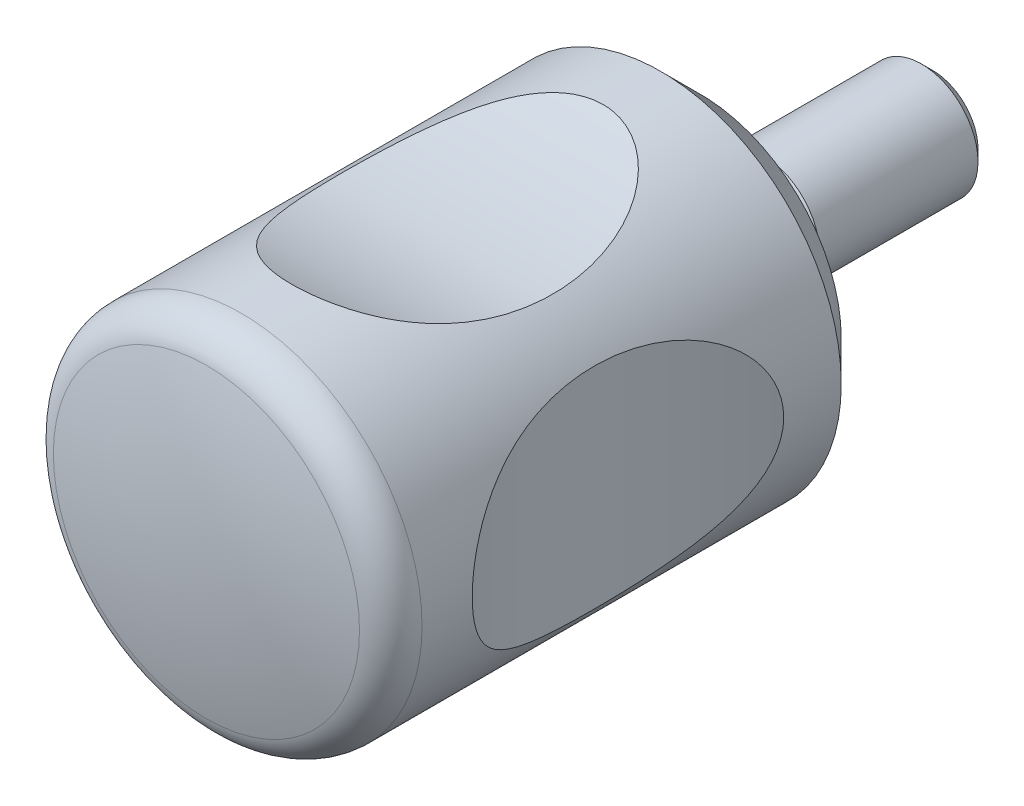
ISO-10303-21;
HEADER;
FILE_DESCRIPTION(('STEP AP214'),'2;1');
FILE_NAME('part.step','',(''),(''),'','','');
FILE_SCHEMA(('AUTOMOTIVE_DESIGN { 1 0 10303 214 1 1 1 1 }'));
ENDSEC;
DATA;
#1=APPLICATION_CONTEXT('core data for automotive mechanical design processes');
#2=APPLICATION_PROTOCOL_DEFINITION('international standard','automotive_design',2000,#1);
#3=PRODUCT_CONTEXT('',#1,'mechanical');
#4=PRODUCT('Part','Part','',(#3));
#5=PRODUCT_RELATED_PRODUCT_CATEGORY('part','',(#4));
#6=PRODUCT_DEFINITION_FORMATION('','',#4);
#7=PRODUCT_DEFINITION_CONTEXT('part definition',#1,'design');
#8=PRODUCT_DEFINITION('design','',#6,#7);
#9=PRODUCT_DEFINITION_SHAPE('','',#8);
#10=(LENGTH_UNIT() NAMED_UNIT(*) SI_UNIT(.MILLI.,.METRE.));
#11=(NAMED_UNIT(*) PLANE_ANGLE_UNIT() SI_UNIT($,.RADIAN.));
#12=(NAMED_UNIT(*) SI_UNIT($,.STERADIAN.) SOLID_ANGLE_UNIT());
#13=UNCERTAINTY_MEASURE_WITH_UNIT(LENGTH_MEASURE(1.E-05),#10,'distance_accuracy_value','');
#14=(GEOMETRIC_REPRESENTATION_CONTEXT(3) GLOBAL_UNCERTAINTY_ASSIGNED_CONTEXT((#13)) GLOBAL_UNIT_ASSIGNED_CONTEXT((#10,
#11,#12)) REPRESENTATION_CONTEXT('',''));
#15=CARTESIAN_POINT('',(0.,0.,0.));
#16=DIRECTION('',(0.,0.,1.));
#17=DIRECTION('',(1.,0.,0.));
#18=AXIS2_PLACEMENT_3D('',#15,#16,#17);
#19=CARTESIAN_POINT('',(0.,0.,23.));
#20=DIRECTION('',(0.,0.,1.));
#21=DIRECTION('',(1.,0.,0.));
#22=AXIS2_PLACEMENT_3D('',#19,#20,#21);
#23=CYLINDRICAL_SURFACE('',#22,8.);
#24=CARTESIAN_POINT('',(0.,0.,20.6246361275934));
#25=DIRECTION('',(0.,0.,1.));
#26=DIRECTION('',(1.,0.,0.));
#27=AXIS2_PLACEMENT_3D('',#24,#25,#26);
#28=CIRCLE('',#27,8.);
#29=CARTESIAN_POINT('',(8.,0.,20.6246361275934));
#30=VERTEX_POINT('',#29);
#31=EDGE_CURVE('E188',#30,#30,#28,.T.);
#32=ORIENTED_EDGE('',*,*,#31,.F.);
#33=EDGE_LOOP('',(#32));
#34=FACE_BOUND('',#33,.T.);
#35=CARTESIAN_POINT('',(-8.,0.,18.4));
#36=CARTESIAN_POINT('',(-7.99998865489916,0.193488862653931,18.399983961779));
#37=CARTESIAN_POINT('',(-7.99290645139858,0.387149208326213,18.3845209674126));
#38=CARTESIAN_POINT('',(-7.9653036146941,0.768502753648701,18.3235350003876));
#39=CARTESIAN_POINT('',(-7.94478472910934,0.956196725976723,18.2780159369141));
#40=CARTESIAN_POINT('',(-7.89245870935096,1.32014258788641,18.159617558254));
#41=CARTESIAN_POINT('',(-7.86069724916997,1.49643740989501,18.0868488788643));
#42=CARTESIAN_POINT('',(-7.78861572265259,1.83507929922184,17.9172838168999));
#43=CARTESIAN_POINT('',(-7.74829187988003,1.99742016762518,17.8204768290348));
#44=CARTESIAN_POINT('',(-7.64527484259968,2.36629171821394,17.5648800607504));
#45=CARTESIAN_POINT('',(-7.57997271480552,2.56552986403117,17.3966144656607));
#46=CARTESIAN_POINT('',(-7.44570706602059,2.9325559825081,17.029837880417));
#47=CARTESIAN_POINT('',(-7.37673659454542,3.10028131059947,16.8312680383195));
#48=CARTESIAN_POINT('',(-7.26192483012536,3.35822632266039,16.4768611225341));
#49=CARTESIAN_POINT('',(-7.21553370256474,3.45636493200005,16.3268272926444));
#50=CARTESIAN_POINT('',(-7.12507753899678,3.63918784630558,16.0180427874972));
#51=CARTESIAN_POINT('',(-7.08101335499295,3.72386724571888,15.8592889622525));
#52=CARTESIAN_POINT('',(-6.99628588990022,3.8807133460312,15.5346541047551));
#53=CARTESIAN_POINT('',(-6.95562654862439,3.95286565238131,15.3687651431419));
#54=CARTESIAN_POINT('',(-6.87858276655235,4.08545834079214,15.0313922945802));
#55=CARTESIAN_POINT('',(-6.84219941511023,4.14589574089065,14.8599069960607));
#56=CARTESIAN_POINT('',(-6.76240817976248,4.27522000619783,14.4514009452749));
#57=CARTESIAN_POINT('',(-6.72103207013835,4.3395993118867,14.2125486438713));
#58=CARTESIAN_POINT('',(-6.64835375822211,4.45014030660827,13.7291437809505));
#59=CARTESIAN_POINT('',(-6.61705496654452,4.49629582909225,13.4845893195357));
#60=CARTESIAN_POINT('',(-6.56520705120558,4.57166800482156,12.9915521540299));
#61=CARTESIAN_POINT('',(-6.54466748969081,4.60086959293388,12.7430661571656));
#62=CARTESIAN_POINT('',(-6.51478424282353,4.6430862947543,12.2440968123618));
#63=CARTESIAN_POINT('',(-6.5054393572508,4.65610314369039,11.9936136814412));
#64=CARTESIAN_POINT('',(-6.49805233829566,4.66640745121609,11.4881865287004));
#65=CARTESIAN_POINT('',(-6.50019160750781,4.66344245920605,11.2332347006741));
#66=CARTESIAN_POINT('',(-6.51615668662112,4.64110895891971,10.724379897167));
#67=CARTESIAN_POINT('',(-6.52998388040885,4.62173850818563,10.4704770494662));
#68=CARTESIAN_POINT('',(-6.56904475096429,4.56604952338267,9.96561640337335));
#69=CARTESIAN_POINT('',(-6.59426930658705,4.52974454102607,9.7146564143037));
#70=CARTESIAN_POINT('',(-6.65559215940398,4.43915567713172,9.21737609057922));
#71=CARTESIAN_POINT('',(-6.69168711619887,4.38487731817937,8.97105435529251));
#72=CARTESIAN_POINT('',(-6.76351056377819,4.27295392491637,8.54641382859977));
#73=CARTESIAN_POINT('',(-6.79704391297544,4.21959611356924,8.36658596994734));
#74=CARTESIAN_POINT('',(-6.86914970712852,4.10117019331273,8.01187811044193));
#75=CARTESIAN_POINT('',(-6.90772102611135,4.03610469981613,7.83699701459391));
#76=CARTESIAN_POINT('',(-6.98913679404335,3.89341878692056,7.49366442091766));
#77=CARTESIAN_POINT('',(-7.03197633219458,3.81581273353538,7.32520583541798));
#78=CARTESIAN_POINT('',(-7.120961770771,3.64705153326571,6.99619642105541));
#79=CARTESIAN_POINT('',(-7.16710659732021,3.5559007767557,6.83564305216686));
#80=CARTESIAN_POINT('',(-7.28287880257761,3.31435670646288,6.45364821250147));
#81=CARTESIAN_POINT('',(-7.35367382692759,3.15583225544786,6.23757427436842));
#82=CARTESIAN_POINT('',(-7.4942503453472,2.80563973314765,5.83378558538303));
#83=CARTESIAN_POINT('',(-7.56403316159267,2.61402011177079,5.64603011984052));
#84=CARTESIAN_POINT('',(-7.68183913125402,2.24040132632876,5.34301779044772));
#85=CARTESIAN_POINT('',(-7.73138330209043,2.06455359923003,5.22079392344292));
#86=CARTESIAN_POINT('',(-7.82104240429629,1.69337865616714,5.0053897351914));
#87=CARTESIAN_POINT('',(-7.86116155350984,1.49806020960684,4.91219641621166));
#88=CARTESIAN_POINT('',(-7.91121402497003,1.19310730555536,4.79783840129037));
#89=CARTESIAN_POINT('',(-7.92625459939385,1.08896837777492,4.76386386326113));
#90=CARTESIAN_POINT('',(-7.95242209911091,0.877659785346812,4.70514772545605));
#91=CARTESIAN_POINT('',(-7.96355097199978,0.770491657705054,4.68040153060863));
#92=CARTESIAN_POINT('',(-7.98152987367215,0.554044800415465,4.64058266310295));
#93=CARTESIAN_POINT('',(-7.98838116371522,0.444766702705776,4.62550713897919));
#94=CARTESIAN_POINT('',(-7.99758820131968,0.22514631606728,4.60527972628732));
#95=CARTESIAN_POINT('',(-7.99994452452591,0.114804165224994,4.60012656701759));
#96=CARTESIAN_POINT('',(-8.00009344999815,-0.188186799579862,4.59978649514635));
#97=CARTESIAN_POINT('',(-7.99318376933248,-0.380967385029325,4.61487253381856));
#98=CARTESIAN_POINT('',(-7.96603375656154,-0.760687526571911,4.67484618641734));
#99=CARTESIAN_POINT('',(-7.94579487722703,-0.947627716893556,4.71973055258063));
#100=CARTESIAN_POINT('',(-7.8943098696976,-1.3087158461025,4.83616402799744));
#101=CARTESIAN_POINT('',(-7.86320317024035,-1.48299354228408,4.90737601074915));
#102=CARTESIAN_POINT('',(-7.7925688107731,-1.81803716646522,5.07330770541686));
#103=CARTESIAN_POINT('',(-7.75303774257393,-1.97879758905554,5.16803693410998));
#104=CARTESIAN_POINT('',(-7.65146206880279,-2.34617785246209,5.41941010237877));
#105=CARTESIAN_POINT('',(-7.5867305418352,-2.54547872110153,5.58567309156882));
#106=CARTESIAN_POINT('',(-7.45340759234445,-2.91293183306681,5.94845496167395));
#107=CARTESIAN_POINT('',(-7.38480873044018,-3.0810211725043,6.14503351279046));
#108=CARTESIAN_POINT('',(-7.27049490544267,-3.33963509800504,6.49595951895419));
#109=CARTESIAN_POINT('',(-7.22428586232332,-3.43804108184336,6.64447670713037));
#110=CARTESIAN_POINT('',(-7.13408459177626,-3.62150549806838,6.95024299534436));
#111=CARTESIAN_POINT('',(-7.09009317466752,-3.70655907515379,7.10749524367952));
#112=CARTESIAN_POINT('',(-7.00540151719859,-3.86424203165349,7.42914971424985));
#113=CARTESIAN_POINT('',(-6.96470508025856,-3.93685715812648,7.59355987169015));
#114=CARTESIAN_POINT('',(-6.88747896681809,-4.07045182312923,7.92800594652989));
#115=CARTESIAN_POINT('',(-6.85095035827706,-4.13142838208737,8.09804329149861));
#116=CARTESIAN_POINT('',(-6.77059009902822,-4.26227119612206,8.50371093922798));
#117=CARTESIAN_POINT('',(-6.72876665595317,-4.3276137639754,8.7412058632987));
#118=CARTESIAN_POINT('',(-6.65505849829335,-4.44012392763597,9.2219921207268));
#119=CARTESIAN_POINT('',(-6.62317718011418,-4.48728531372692,9.4652854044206));
#120=CARTESIAN_POINT('',(-6.57004340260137,-4.56472720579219,9.95589213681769));
#121=CARTESIAN_POINT('',(-6.54880028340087,-4.59499288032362,10.2032089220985));
#122=CARTESIAN_POINT('',(-6.5174025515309,-4.63941795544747,10.6999406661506));
#123=CARTESIAN_POINT('',(-6.5072467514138,-4.65357908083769,10.9493553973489));
#124=CARTESIAN_POINT('',(-6.49812839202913,-4.66630382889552,11.452875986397));
#125=CARTESIAN_POINT('',(-6.49935190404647,-4.66460816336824,11.7069917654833));
#126=CARTESIAN_POINT('',(-6.51341814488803,-4.64494690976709,12.2143061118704));
#127=CARTESIAN_POINT('',(-6.52626219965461,-4.62697946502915,12.4675045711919));
#128=CARTESIAN_POINT('',(-6.56331325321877,-4.57427123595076,12.9711328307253));
#129=CARTESIAN_POINT('',(-6.58751186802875,-4.53954282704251,13.2215645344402));
#130=CARTESIAN_POINT('',(-6.6467688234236,-4.45233209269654,13.7179903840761));
#131=CARTESIAN_POINT('',(-6.68182400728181,-4.39985492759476,13.9639857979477));
#132=CARTESIAN_POINT('',(-6.75225442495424,-4.29070740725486,14.3906965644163));
#133=CARTESIAN_POINT('',(-6.78550270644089,-4.23811913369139,14.5728140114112));
#134=CARTESIAN_POINT('',(-6.85720876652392,-4.12109277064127,14.9321364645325));
#135=CARTESIAN_POINT('',(-6.89566540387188,-4.05665727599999,15.1093425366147));
#136=CARTESIAN_POINT('',(-6.97702322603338,-3.91507466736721,15.4573446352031));
#137=CARTESIAN_POINT('',(-7.01991931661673,-3.83794206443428,15.6281477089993));
#138=CARTESIAN_POINT('',(-7.10918562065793,-3.66994669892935,15.9618475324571));
#139=CARTESIAN_POINT('',(-7.15555468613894,-3.57908846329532,16.1247468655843));
#140=CARTESIAN_POINT('',(-7.27181424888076,-3.33853274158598,16.511612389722));
#141=CARTESIAN_POINT('',(-7.34294295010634,-3.18070204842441,16.7302752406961));
#142=CARTESIAN_POINT('',(-7.48448311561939,-2.83157179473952,17.1393061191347));
#143=CARTESIAN_POINT('',(-7.55489548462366,-2.6403220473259,17.3297154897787));
#144=CARTESIAN_POINT('',(-7.67396401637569,-2.26721264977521,17.637245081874));
#145=CARTESIAN_POINT('',(-7.72410419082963,-2.0916269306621,17.7613754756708));
#146=CARTESIAN_POINT('',(-7.81509039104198,-1.72064691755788,17.9806081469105));
#147=CARTESIAN_POINT('',(-7.85593972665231,-1.52525971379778,18.0757207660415));
#148=CARTESIAN_POINT('',(-7.90748214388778,-1.21779646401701,18.1936990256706));
#149=CARTESIAN_POINT('',(-7.92319163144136,-1.111281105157,18.2292303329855));
#150=CARTESIAN_POINT('',(-7.95052260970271,-0.895008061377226,18.2906176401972));
#151=CARTESIAN_POINT('',(-7.96214618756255,-0.78525206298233,18.3164785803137));
#152=CARTESIAN_POINT('',(-7.98090562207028,-0.563487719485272,18.3580426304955));
#153=CARTESIAN_POINT('',(-7.98804306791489,-0.451480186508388,18.373749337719));
#154=CARTESIAN_POINT('',(-7.99759320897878,-0.226334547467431,18.3947319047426));
#155=CARTESIAN_POINT('',(-8.00000663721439,-0.11319661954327,18.4000093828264));
#156=CARTESIAN_POINT('',(-8.,0.,18.4));
#157=B_SPLINE_CURVE_WITH_KNOTS('',3,(#35,#36,#37,#38,#39,#40,#41,#42,#43,#44,#45,#46,#47,#48,
#49,#50,#51,#52,#53,#54,#55,#56,#57,#58,#59,#60,#61,#62,#63,#64,#65,#66,#67,#68,#69,#70,#71,#72,
#73,#74,#75,#76,#77,#78,#79,#80,#81,#82,#83,#84,#85,#86,#87,#88,#89,#90,#91,#92,#93,#94,#95,#96,
#97,#98,#99,#100,#101,#102,#103,#104,#105,#106,#107,#108,#109,#110,#111,#112,#113,#114,#115,
#116,#117,#118,#119,#120,#121,#122,#123,#124,#125,#126,#127,#128,#129,#130,#131,#132,#133,#134,
#135,#136,#137,#138,#139,#140,#141,#142,#143,#144,#145,#146,#147,#148,#149,#150,#151,#152,#153,
#154,#155,#156),.UNSPECIFIED.,.T.,.F.,(4,2,2,2,2,2,2,2,2,2,2,2,2,2,2,2,2,2,2,2,2,2,2,2,2,2,2,2,
2,2,2,2,2,2,2,2,2,2,2,2,2,2,2,2,2,2,2,2,2,2,2,2,2,2,2,2,2,2,2,2,4),(0.,0.580040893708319,
1.16000636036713,1.73764220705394,2.3155333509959,3.11763735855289,3.92131938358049,
4.47618184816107,5.03124608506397,5.58694396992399,6.14278311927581,6.89416897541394,
7.64580886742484,8.39811564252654,9.15034175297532,9.91448457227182,10.6787178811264,
11.4423406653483,12.2057290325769,12.77694419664,13.348031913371,13.9184699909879,
14.488723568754,15.3173212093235,16.1447159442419,16.8016473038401,17.4582841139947,
17.7895737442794,18.1206981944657,18.451724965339,18.7827093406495,19.3600512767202,
19.9373302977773,20.5074597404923,21.0778202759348,21.8759182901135,22.6756077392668,
23.2270854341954,23.7787631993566,24.3310689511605,24.883515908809,25.6320005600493,
26.3807406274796,27.1301369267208,27.8794529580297,28.6410428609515,29.4027196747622,
30.1638349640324,30.9247291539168,31.5016398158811,32.0784242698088,32.6545540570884,
33.2304942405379,34.0642298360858,34.8967331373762,35.5566362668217,36.2163039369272,
36.5559915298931,36.8955053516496,37.2348988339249,37.5742396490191),.UNSPECIFIED.);
#158=CARTESIAN_POINT('',(-8.,0.,18.4));
#159=VERTEX_POINT('',#158);
#160=EDGE_CURVE('E9',#159,#159,#157,.T.);
#161=ORIENTED_EDGE('',*,*,#160,.F.);
#162=EDGE_LOOP('',(#161));
#163=FACE_BOUND('',#162,.T.);
#164=CARTESIAN_POINT('',(0.,-8.,18.4));
#165=CARTESIAN_POINT('',(-0.19348886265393,-7.99998865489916,18.399983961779));
#166=CARTESIAN_POINT('',(-0.387149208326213,-7.99290645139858,18.3845209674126));
#167=CARTESIAN_POINT('',(-0.768502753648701,-7.9653036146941,18.3235350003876));
#168=CARTESIAN_POINT('',(-0.956196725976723,-7.94478472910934,18.2780159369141));
#169=CARTESIAN_POINT('',(-1.32014258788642,-7.89245870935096,18.159617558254));
#170=CARTESIAN_POINT('',(-1.49643740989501,-7.86069724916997,18.0868488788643));
#171=CARTESIAN_POINT('',(-1.83507929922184,-7.78861572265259,17.9172838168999));
#172=CARTESIAN_POINT('',(-1.99742016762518,-7.74829187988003,17.8204768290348));
#173=CARTESIAN_POINT('',(-2.36629171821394,-7.64527484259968,17.5648800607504));
#174=CARTESIAN_POINT('',(-2.56552986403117,-7.57997271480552,17.3966144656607));
#175=CARTESIAN_POINT('',(-2.93255598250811,-7.44570706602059,17.029837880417));
#176=CARTESIAN_POINT('',(-3.10028131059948,-7.37673659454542,16.8312680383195));
#177=CARTESIAN_POINT('',(-3.35822632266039,-7.26192483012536,16.4768611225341));
#178=CARTESIAN_POINT('',(-3.45636493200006,-7.21553370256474,16.3268272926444));
#179=CARTESIAN_POINT('',(-3.63918784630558,-7.12507753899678,16.0180427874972));
#180=CARTESIAN_POINT('',(-3.72386724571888,-7.08101335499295,15.8592889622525));
#181=CARTESIAN_POINT('',(-3.8807133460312,-6.99628588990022,15.5346541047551));
#182=CARTESIAN_POINT('',(-3.95286565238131,-6.95562654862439,15.3687651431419));
#183=CARTESIAN_POINT('',(-4.08545834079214,-6.87858276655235,15.0313922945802));
#184=CARTESIAN_POINT('',(-4.14589574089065,-6.84219941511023,14.8599069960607));
#185=CARTESIAN_POINT('',(-4.27522000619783,-6.76240817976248,14.4514009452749));
#186=CARTESIAN_POINT('',(-4.3395993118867,-6.72103207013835,14.2125486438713));
#187=CARTESIAN_POINT('',(-4.45014030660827,-6.64835375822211,13.7291437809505));
#188=CARTESIAN_POINT('',(-4.49629582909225,-6.61705496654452,13.4845893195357));
#189=CARTESIAN_POINT('',(-4.57166800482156,-6.56520705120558,12.9915521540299));
#190=CARTESIAN_POINT('',(-4.60086959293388,-6.5446674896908,12.7430661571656));
#191=CARTESIAN_POINT('',(-4.64308629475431,-6.51478424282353,12.2440968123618));
#192=CARTESIAN_POINT('',(-4.65610314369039,-6.5054393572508,11.9936136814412));
#193=CARTESIAN_POINT('',(-4.66640745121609,-6.49805233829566,11.4881865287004));
#194=CARTESIAN_POINT('',(-4.66344245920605,-6.5001916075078,11.2332347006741));
#195=CARTESIAN_POINT('',(-4.64110895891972,-6.51615668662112,10.724379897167));
#196=CARTESIAN_POINT('',(-4.62173850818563,-6.52998388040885,10.4704770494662));
#197=CARTESIAN_POINT('',(-4.56604952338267,-6.56904475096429,9.96561640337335));
#198=CARTESIAN_POINT('',(-4.52974454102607,-6.59426930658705,9.7146564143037));
#199=CARTESIAN_POINT('',(-4.43915567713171,-6.65559215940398,9.21737609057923));
#200=CARTESIAN_POINT('',(-4.38487731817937,-6.69168711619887,8.97105435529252));
#201=CARTESIAN_POINT('',(-4.27295392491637,-6.76351056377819,8.54641382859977));
#202=CARTESIAN_POINT('',(-4.21959611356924,-6.79704391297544,8.36658596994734));
#203=CARTESIAN_POINT('',(-4.10117019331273,-6.86914970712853,8.01187811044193));
#204=CARTESIAN_POINT('',(-4.03610469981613,-6.90772102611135,7.83699701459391));
#205=CARTESIAN_POINT('',(-3.89341878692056,-6.98913679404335,7.49366442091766));
#206=CARTESIAN_POINT('',(-3.81581273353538,-7.03197633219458,7.32520583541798));
#207=CARTESIAN_POINT('',(-3.64705153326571,-7.120961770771,6.99619642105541));
#208=CARTESIAN_POINT('',(-3.5559007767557,-7.16710659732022,6.83564305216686));
#209=CARTESIAN_POINT('',(-3.31435670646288,-7.28287880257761,6.45364821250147));
#210=CARTESIAN_POINT('',(-3.15583225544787,-7.35367382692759,6.23757427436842));
#211=CARTESIAN_POINT('',(-2.80563973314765,-7.4942503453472,5.83378558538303));
#212=CARTESIAN_POINT('',(-2.61402011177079,-7.56403316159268,5.64603011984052));
#213=CARTESIAN_POINT('',(-2.24040132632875,-7.68183913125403,5.34301779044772));
#214=CARTESIAN_POINT('',(-2.06455359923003,-7.73138330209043,5.22079392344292));
#215=CARTESIAN_POINT('',(-1.69337865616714,-7.82104240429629,5.0053897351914));
#216=CARTESIAN_POINT('',(-1.49806020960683,-7.86116155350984,4.91219641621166));
#217=CARTESIAN_POINT('',(-1.19310730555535,-7.91121402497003,4.79783840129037));
#218=CARTESIAN_POINT('',(-1.08896837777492,-7.92625459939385,4.76386386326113));
#219=CARTESIAN_POINT('',(-0.877659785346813,-7.95242209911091,4.70514772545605));
#220=CARTESIAN_POINT('',(-0.770491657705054,-7.96355097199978,4.68040153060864));
#221=CARTESIAN_POINT('',(-0.554044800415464,-7.98152987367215,4.64058266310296));
#222=CARTESIAN_POINT('',(-0.444766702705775,-7.98838116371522,4.62550713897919));
#223=CARTESIAN_POINT('',(-0.225146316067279,-7.99758820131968,4.60527972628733));
#224=CARTESIAN_POINT('',(-0.114804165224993,-7.99994452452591,4.60012656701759));
#225=CARTESIAN_POINT('',(0.188186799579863,-8.00009344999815,4.59978649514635));
#226=CARTESIAN_POINT('',(0.380967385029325,-7.99318376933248,4.61487253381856));
#227=CARTESIAN_POINT('',(0.760687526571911,-7.96603375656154,4.67484618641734));
#228=CARTESIAN_POINT('',(0.947627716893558,-7.94579487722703,4.71973055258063));
#229=CARTESIAN_POINT('',(1.30871584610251,-7.8943098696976,4.83616402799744));
#230=CARTESIAN_POINT('',(1.48299354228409,-7.86320317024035,4.90737601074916));
#231=CARTESIAN_POINT('',(1.81803716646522,-7.7925688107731,5.07330770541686));
#232=CARTESIAN_POINT('',(1.97879758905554,-7.75303774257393,5.16803693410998));
#233=CARTESIAN_POINT('',(2.3461778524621,-7.6514620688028,5.41941010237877));
#234=CARTESIAN_POINT('',(2.54547872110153,-7.5867305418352,5.58567309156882));
#235=CARTESIAN_POINT('',(2.91293183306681,-7.45340759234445,5.94845496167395));
#236=CARTESIAN_POINT('',(3.0810211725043,-7.38480873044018,6.14503351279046));
#237=CARTESIAN_POINT('',(3.33963509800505,-7.27049490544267,6.4959595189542));
#238=CARTESIAN_POINT('',(3.43804108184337,-7.22428586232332,6.64447670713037));
#239=CARTESIAN_POINT('',(3.62150549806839,-7.13408459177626,6.95024299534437));
#240=CARTESIAN_POINT('',(3.7065590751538,-7.09009317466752,7.10749524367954));
#241=CARTESIAN_POINT('',(3.86424203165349,-7.00540151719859,7.42914971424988));
#242=CARTESIAN_POINT('',(3.9368571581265,-6.96470508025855,7.59355987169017));
#243=CARTESIAN_POINT('',(4.07045182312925,-6.88747896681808,7.92800594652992));
#244=CARTESIAN_POINT('',(4.13142838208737,-6.85095035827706,8.09804329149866));
#245=CARTESIAN_POINT('',(4.26227119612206,-6.77059009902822,8.50371093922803));
#246=CARTESIAN_POINT('',(4.32761376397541,-6.72876665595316,8.74120586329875));
#247=CARTESIAN_POINT('',(4.44012392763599,-6.65505849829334,9.22199212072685));
#248=CARTESIAN_POINT('',(4.48728531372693,-6.62317718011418,9.46528540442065));
#249=CARTESIAN_POINT('',(4.56472720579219,-6.57004340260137,9.95589213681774));
#250=CARTESIAN_POINT('',(4.59499288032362,-6.54880028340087,10.2032089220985));
#251=CARTESIAN_POINT('',(4.63941795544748,-6.5174025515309,10.6999406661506));
#252=CARTESIAN_POINT('',(4.65357908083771,-6.5072467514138,10.9493553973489));
#253=CARTESIAN_POINT('',(4.66630382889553,-6.49812839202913,11.4528759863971));
#254=CARTESIAN_POINT('',(4.66460816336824,-6.49935190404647,11.7069917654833));
#255=CARTESIAN_POINT('',(4.64494690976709,-6.51341814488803,12.2143061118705));
#256=CARTESIAN_POINT('',(4.62697946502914,-6.52626219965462,12.4675045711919));
#257=CARTESIAN_POINT('',(4.57427123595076,-6.56331325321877,12.9711328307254));
#258=CARTESIAN_POINT('',(4.53954282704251,-6.58751186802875,13.2215645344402));
#259=CARTESIAN_POINT('',(4.45233209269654,-6.64676882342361,13.7179903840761));
#260=CARTESIAN_POINT('',(4.39985492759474,-6.68182400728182,13.9639857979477));
#261=CARTESIAN_POINT('',(4.29070740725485,-6.75225442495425,14.3906965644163));
#262=CARTESIAN_POINT('',(4.23811913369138,-6.78550270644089,14.5728140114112));
#263=CARTESIAN_POINT('',(4.12109277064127,-6.85720876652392,14.9321364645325));
#264=CARTESIAN_POINT('',(4.05665727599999,-6.89566540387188,15.1093425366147));
#265=CARTESIAN_POINT('',(3.9150746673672,-6.97702322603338,15.4573446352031));
#266=CARTESIAN_POINT('',(3.83794206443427,-7.01991931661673,15.6281477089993));
#267=CARTESIAN_POINT('',(3.66994669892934,-7.10918562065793,15.9618475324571));
#268=CARTESIAN_POINT('',(3.57908846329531,-7.15555468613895,16.1247468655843));
#269=CARTESIAN_POINT('',(3.33853274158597,-7.27181424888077,16.511612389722));
#270=CARTESIAN_POINT('',(3.1807020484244,-7.34294295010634,16.7302752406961));
#271=CARTESIAN_POINT('',(2.83157179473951,-7.4844831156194,17.1393061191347));
#272=CARTESIAN_POINT('',(2.6403220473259,-7.55489548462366,17.3297154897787));
#273=CARTESIAN_POINT('',(2.26721264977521,-7.67396401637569,17.637245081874));
#274=CARTESIAN_POINT('',(2.0916269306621,-7.72410419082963,17.7613754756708));
#275=CARTESIAN_POINT('',(1.72064691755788,-7.81509039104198,17.9806081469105));
#276=CARTESIAN_POINT('',(1.52525971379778,-7.85593972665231,18.0757207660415));
#277=CARTESIAN_POINT('',(1.21779646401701,-7.90748214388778,18.1936990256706));
#278=CARTESIAN_POINT('',(1.111281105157,-7.92319163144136,18.2292303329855));
#279=CARTESIAN_POINT('',(0.895008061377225,-7.95052260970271,18.2906176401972));
#280=CARTESIAN_POINT('',(0.785252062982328,-7.96214618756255,18.3164785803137));
#281=CARTESIAN_POINT('',(0.563487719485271,-7.98090562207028,18.3580426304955));
#282=CARTESIAN_POINT('',(0.451480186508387,-7.98804306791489,18.373749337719));
#283=CARTESIAN_POINT('',(0.226334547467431,-7.99759320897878,18.3947319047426));
#284=CARTESIAN_POINT('',(0.11319661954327,-8.00000663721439,18.4000093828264));
#285=CARTESIAN_POINT('',(0.,-8.,18.4));
#286=B_SPLINE_CURVE_WITH_KNOTS('',3,(#164,#165,#166,#167,#168,#169,#170,#171,#172,#173,#174,
#175,#176,#177,#178,#179,#180,#181,#182,#183,#184,#185,#186,#187,#188,#189,#190,#191,#192,#193,
#194,#195,#196,#197,#198,#199,#200,#201,#202,#203,#204,#205,#206,#207,#208,#209,#210,#211,#212,
#213,#214,#215,#216,#217,#218,#219,#220,#221,#222,#223,#224,#225,#226,#227,#228,#229,#230,#231,
#232,#233,#234,#235,#236,#237,#238,#239,#240,#241,#242,#243,#244,#245,#246,#247,#248,#249,#250,
#251,#252,#253,#254,#255,#256,#257,#258,#259,#260,#261,#262,#263,#264,#265,#266,#267,#268,#269,
#270,#271,#272,#273,#274,#275,#276,#277,#278,#279,#280,#281,#282,#283,#284,#285),.UNSPECIFIED.,
.T.,.F.,(4,2,2,2,2,2,2,2,2,2,2,2,2,2,2,2,2,2,2,2,2,2,2,2,2,2,2,2,2,2,2,2,2,2,2,2,2,2,2,2,2,2,2,
2,2,2,2,2,2,2,2,2,2,2,2,2,2,2,2,2,4),(0.,0.580040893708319,1.16000636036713,1.73764220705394,
2.3155333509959,3.11763735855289,3.92131938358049,4.47618184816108,5.03124608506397,
5.58694396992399,6.14278311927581,6.89416897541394,7.64580886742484,8.39811564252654,
9.15034175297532,9.91448457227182,10.6787178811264,11.4423406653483,12.2057290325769,
12.77694419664,13.348031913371,13.9184699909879,14.488723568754,15.3173212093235,
16.1447159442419,16.8016473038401,17.4582841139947,17.7895737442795,18.1206981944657,
18.4517249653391,18.7827093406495,19.3600512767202,19.9373302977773,20.5074597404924,
21.0778202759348,21.8759182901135,22.6756077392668,23.2270854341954,23.7787631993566,
24.3310689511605,24.883515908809,25.6320005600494,26.3807406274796,27.1301369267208,
27.8794529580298,28.6410428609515,29.4027196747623,30.1638349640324,30.9247291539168,
31.5016398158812,32.0784242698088,32.6545540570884,33.2304942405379,34.0642298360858,
34.8967331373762,35.5566362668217,36.2163039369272,36.5559915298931,36.8955053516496,
37.2348988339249,37.5742396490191),.UNSPECIFIED.);
#287=CARTESIAN_POINT('',(0.,-8.,18.4));
#288=VERTEX_POINT('',#287);
#289=EDGE_CURVE('E212',#288,#288,#286,.T.);
#290=ORIENTED_EDGE('',*,*,#289,.F.);
#291=EDGE_LOOP('',(#290));
#292=FACE_BOUND('',#291,.T.);
#293=CARTESIAN_POINT('',(0.,8.,4.6));
#294=CARTESIAN_POINT('',(-0.193488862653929,7.99998865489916,4.60001603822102));
#295=CARTESIAN_POINT('',(-0.387149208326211,7.99290645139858,4.61547903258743));
#296=CARTESIAN_POINT('',(-0.768502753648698,7.9653036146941,4.67646499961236));
#297=CARTESIAN_POINT('',(-0.956196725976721,7.94478472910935,4.72198406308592));
#298=CARTESIAN_POINT('',(-1.32014258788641,7.89245870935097,4.84038244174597));
#299=CARTESIAN_POINT('',(-1.496437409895,7.86069724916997,4.91315112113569));
#300=CARTESIAN_POINT('',(-1.83507929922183,7.78861572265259,5.08271618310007));
#301=CARTESIAN_POINT('',(-1.99742016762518,7.74829187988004,5.17952317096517));
#302=CARTESIAN_POINT('',(-2.36629171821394,7.64527484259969,5.43511993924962));
#303=CARTESIAN_POINT('',(-2.56552986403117,7.57997271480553,5.60338553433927));
#304=CARTESIAN_POINT('',(-2.9325559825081,7.44570706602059,5.97016211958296));
#305=CARTESIAN_POINT('',(-3.10028131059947,7.37673659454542,6.16873196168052));
#306=CARTESIAN_POINT('',(-3.35822632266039,7.26192483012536,6.5231388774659));
#307=CARTESIAN_POINT('',(-3.45636493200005,7.21553370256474,6.67317270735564));
#308=CARTESIAN_POINT('',(-3.63918784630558,7.12507753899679,6.98195721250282));
#309=CARTESIAN_POINT('',(-3.72386724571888,7.08101335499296,7.14071103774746));
#310=CARTESIAN_POINT('',(-3.8807133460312,6.99628588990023,7.46534589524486));
#311=CARTESIAN_POINT('',(-3.95286565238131,6.95562654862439,7.63123485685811));
#312=CARTESIAN_POINT('',(-4.08545834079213,6.87858276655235,7.96860770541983));
#313=CARTESIAN_POINT('',(-4.14589574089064,6.84219941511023,8.14009300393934));
#314=CARTESIAN_POINT('',(-4.27522000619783,6.76240817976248,8.54859905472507));
#315=CARTESIAN_POINT('',(-4.3395993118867,6.72103207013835,8.78745135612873));
#316=CARTESIAN_POINT('',(-4.45014030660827,6.64835375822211,9.27085621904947));
#317=CARTESIAN_POINT('',(-4.49629582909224,6.61705496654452,9.51541068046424));
#318=CARTESIAN_POINT('',(-4.57166800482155,6.56520705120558,10.0084478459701));
#319=CARTESIAN_POINT('',(-4.60086959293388,6.54466748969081,10.2569338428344));
#320=CARTESIAN_POINT('',(-4.6430862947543,6.51478424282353,10.7559031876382));
#321=CARTESIAN_POINT('',(-4.65610314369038,6.5054393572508,11.0063863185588));
#322=CARTESIAN_POINT('',(-4.66640745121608,6.49805233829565,11.5118134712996));
#323=CARTESIAN_POINT('',(-4.66344245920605,6.5001916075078,11.7667652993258));
#324=CARTESIAN_POINT('',(-4.64110895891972,6.51615668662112,12.275620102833));
#325=CARTESIAN_POINT('',(-4.62173850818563,6.52998388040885,12.5295229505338));
#326=CARTESIAN_POINT('',(-4.56604952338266,6.56904475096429,13.0343835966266));
#327=CARTESIAN_POINT('',(-4.52974454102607,6.59426930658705,13.2853435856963));
#328=CARTESIAN_POINT('',(-4.43915567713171,6.65559215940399,13.7826239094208));
#329=CARTESIAN_POINT('',(-4.38487731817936,6.69168711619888,14.0289456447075));
#330=CARTESIAN_POINT('',(-4.27295392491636,6.7635105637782,14.4535861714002));
#331=CARTESIAN_POINT('',(-4.21959611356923,6.79704391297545,14.6334140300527));
#332=CARTESIAN_POINT('',(-4.10117019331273,6.86914970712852,14.9881218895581));
#333=CARTESIAN_POINT('',(-4.03610469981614,6.90772102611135,15.1630029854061));
#334=CARTESIAN_POINT('',(-3.89341878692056,6.98913679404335,15.5063355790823));
#335=CARTESIAN_POINT('',(-3.81581273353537,7.03197633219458,15.674794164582));
#336=CARTESIAN_POINT('',(-3.64705153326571,7.120961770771,16.0038035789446));
#337=CARTESIAN_POINT('',(-3.5559007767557,7.16710659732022,16.1643569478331));
#338=CARTESIAN_POINT('',(-3.31435670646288,7.28287880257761,16.5463517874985));
#339=CARTESIAN_POINT('',(-3.15583225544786,7.35367382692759,16.7624257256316));
#340=CARTESIAN_POINT('',(-2.80563973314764,7.4942503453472,17.166214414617));
#341=CARTESIAN_POINT('',(-2.61402011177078,7.56403316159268,17.3539698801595));
#342=CARTESIAN_POINT('',(-2.24040132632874,7.68183913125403,17.6569822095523));
#343=CARTESIAN_POINT('',(-2.06455359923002,7.73138330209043,17.7792060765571));
#344=CARTESIAN_POINT('',(-1.69337865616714,7.82104240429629,17.9946102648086));
#345=CARTESIAN_POINT('',(-1.49806020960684,7.86116155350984,18.0878035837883));
#346=CARTESIAN_POINT('',(-1.19310730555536,7.91121402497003,18.2021615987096));
#347=CARTESIAN_POINT('',(-1.08896837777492,7.92625459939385,18.2361361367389));
#348=CARTESIAN_POINT('',(-0.877659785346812,7.95242209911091,18.2948522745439));
#349=CARTESIAN_POINT('',(-0.770491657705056,7.96355097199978,18.3195984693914));
#350=CARTESIAN_POINT('',(-0.554044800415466,7.98152987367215,18.359417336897));
#351=CARTESIAN_POINT('',(-0.444766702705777,7.98838116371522,18.3744928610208));
#352=CARTESIAN_POINT('',(-0.225146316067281,7.99758820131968,18.3947202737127));
#353=CARTESIAN_POINT('',(-0.114804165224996,7.99994452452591,18.3998734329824));
#354=CARTESIAN_POINT('',(0.188186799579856,8.00009344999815,18.4002135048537));
#355=CARTESIAN_POINT('',(0.380967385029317,7.99318376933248,18.3851274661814));
#356=CARTESIAN_POINT('',(0.760687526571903,7.96603375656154,18.3251538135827));
#357=CARTESIAN_POINT('',(0.947627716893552,7.94579487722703,18.2802694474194));
#358=CARTESIAN_POINT('',(1.3087158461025,7.8943098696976,18.1638359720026));
#359=CARTESIAN_POINT('',(1.48299354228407,7.86320317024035,18.0926239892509));
#360=CARTESIAN_POINT('',(1.8180371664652,7.7925688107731,17.9266922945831));
#361=CARTESIAN_POINT('',(1.97879758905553,7.75303774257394,17.83196306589));
#362=CARTESIAN_POINT('',(2.34617785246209,7.6514620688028,17.5805898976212));
#363=CARTESIAN_POINT('',(2.54547872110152,7.5867305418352,17.4143269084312));
#364=CARTESIAN_POINT('',(2.9129318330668,7.45340759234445,17.0515450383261));
#365=CARTESIAN_POINT('',(3.0810211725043,7.38480873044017,16.8549664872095));
#366=CARTESIAN_POINT('',(3.33963509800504,7.27049490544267,16.5040404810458));
#367=CARTESIAN_POINT('',(3.43804108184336,7.22428586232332,16.3555232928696));
#368=CARTESIAN_POINT('',(3.62150549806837,7.13408459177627,16.0497570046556));
#369=CARTESIAN_POINT('',(3.70655907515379,7.09009317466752,15.8925047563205));
#370=CARTESIAN_POINT('',(3.86424203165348,7.00540151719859,15.5708502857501));
#371=CARTESIAN_POINT('',(3.93685715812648,6.96470508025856,15.4064401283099));
#372=CARTESIAN_POINT('',(4.07045182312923,6.88747896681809,15.0719940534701));
#373=CARTESIAN_POINT('',(4.13142838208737,6.85095035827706,14.9019567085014));
#374=CARTESIAN_POINT('',(4.26227119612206,6.77059009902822,14.496289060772));
#375=CARTESIAN_POINT('',(4.3276137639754,6.72876665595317,14.2587941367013));
#376=CARTESIAN_POINT('',(4.44012392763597,6.65505849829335,13.7780078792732));
#377=CARTESIAN_POINT('',(4.48728531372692,6.62317718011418,13.5347145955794));
#378=CARTESIAN_POINT('',(4.56472720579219,6.57004340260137,13.0441078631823));
#379=CARTESIAN_POINT('',(4.59499288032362,6.54880028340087,12.7967910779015));
#380=CARTESIAN_POINT('',(4.63941795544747,6.5174025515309,12.3000593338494));
#381=CARTESIAN_POINT('',(4.65357908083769,6.5072467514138,12.0506446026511));
#382=CARTESIAN_POINT('',(4.66630382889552,6.49812839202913,11.547124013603));
#383=CARTESIAN_POINT('',(4.66460816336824,6.49935190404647,11.2930082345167));
#384=CARTESIAN_POINT('',(4.64494690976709,6.51341814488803,10.7856938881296));
#385=CARTESIAN_POINT('',(4.62697946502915,6.52626219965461,10.5324954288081));
#386=CARTESIAN_POINT('',(4.57427123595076,6.56331325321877,10.0288671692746));
#387=CARTESIAN_POINT('',(4.53954282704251,6.58751186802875,9.7784354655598));
#388=CARTESIAN_POINT('',(4.45233209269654,6.64676882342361,9.28200961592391));
#389=CARTESIAN_POINT('',(4.39985492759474,6.68182400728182,9.03601420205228));
#390=CARTESIAN_POINT('',(4.29070740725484,6.75225442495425,8.60930343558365));
#391=CARTESIAN_POINT('',(4.23811913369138,6.78550270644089,8.42718598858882));
#392=CARTESIAN_POINT('',(4.12109277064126,6.85720876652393,8.06786353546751));
#393=CARTESIAN_POINT('',(4.05665727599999,6.89566540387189,7.89065746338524));
#394=CARTESIAN_POINT('',(3.91507466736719,6.97702322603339,7.54265536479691));
#395=CARTESIAN_POINT('',(3.83794206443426,7.01991931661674,7.37185229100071));
#396=CARTESIAN_POINT('',(3.66994669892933,7.10918562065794,7.03815246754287));
#397=CARTESIAN_POINT('',(3.57908846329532,7.15555468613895,6.87525313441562));
#398=CARTESIAN_POINT('',(3.33853274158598,7.27181424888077,6.48838761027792));
#399=CARTESIAN_POINT('',(3.18070204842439,7.34294295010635,6.26972475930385));
#400=CARTESIAN_POINT('',(2.8315717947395,7.4844831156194,5.86069388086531));
#401=CARTESIAN_POINT('',(2.64032204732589,7.55489548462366,5.67028451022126));
#402=CARTESIAN_POINT('',(2.26721264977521,7.67396401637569,5.36275491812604));
#403=CARTESIAN_POINT('',(2.0916269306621,7.72410419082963,5.23862452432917));
#404=CARTESIAN_POINT('',(1.72064691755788,7.81509039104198,5.01939185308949));
#405=CARTESIAN_POINT('',(1.52525971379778,7.85593972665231,4.92427923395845));
#406=CARTESIAN_POINT('',(1.21779646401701,7.90748214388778,4.8063009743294));
#407=CARTESIAN_POINT('',(1.111281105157,7.92319163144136,4.77076966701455));
#408=CARTESIAN_POINT('',(0.895008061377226,7.95052260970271,4.70938235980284));
#409=CARTESIAN_POINT('',(0.785252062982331,7.96214618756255,4.68352141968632));
#410=CARTESIAN_POINT('',(0.563487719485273,7.98090562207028,4.64195736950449));
#411=CARTESIAN_POINT('',(0.451480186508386,7.98804306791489,4.62625066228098));
#412=CARTESIAN_POINT('',(0.226334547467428,7.99759320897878,4.60526809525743));
#413=CARTESIAN_POINT('',(0.113196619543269,8.00000663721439,4.59999061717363));
#414=CARTESIAN_POINT('',(0.,8.,4.6));
#415=B_SPLINE_CURVE_WITH_KNOTS('',3,(#293,#294,#295,#296,#297,#298,#299,#300,#301,#302,#303,
#304,#305,#306,#307,#308,#309,#310,#311,#312,#313,#314,#315,#316,#317,#318,#319,#320,#321,#322,
#323,#324,#325,#326,#327,#328,#329,#330,#331,#332,#333,#334,#335,#336,#337,#338,#339,#340,#341,
#342,#343,#344,#345,#346,#347,#348,#349,#350,#351,#352,#353,#354,#355,#356,#357,#358,#359,#360,
#361,#362,#363,#364,#365,#366,#367,#368,#369,#370,#371,#372,#373,#374,#375,#376,#377,#378,#379,
#380,#381,#382,#383,#384,#385,#386,#387,#388,#389,#390,#391,#392,#393,#394,#395,#396,#397,#398,
#399,#400,#401,#402,#403,#404,#405,#406,#407,#408,#409,#410,#411,#412,#413,#414),.UNSPECIFIED.,
.T.,.F.,(4,2,2,2,2,2,2,2,2,2,2,2,2,2,2,2,2,2,2,2,2,2,2,2,2,2,2,2,2,2,2,2,2,2,2,2,2,2,2,2,2,2,2,
2,2,2,2,2,2,2,2,2,2,2,2,2,2,2,2,2,4),(0.,0.580040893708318,1.16000636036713,1.73764220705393,
2.31553335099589,3.11763735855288,3.92131938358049,4.47618184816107,5.03124608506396,
5.58694396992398,6.1427831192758,6.89416897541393,7.64580886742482,8.39811564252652,
9.1503417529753,9.9144845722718,10.6787178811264,11.4423406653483,12.205729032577,
12.77694419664,13.348031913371,13.9184699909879,14.488723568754,15.3173212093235,
16.1447159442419,16.8016473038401,17.4582841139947,17.7895737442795,18.1206981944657,
18.451724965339,18.7827093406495,19.3600512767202,19.9373302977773,20.5074597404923,
21.0778202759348,21.8759182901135,22.6756077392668,23.2270854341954,23.7787631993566,
24.3310689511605,24.883515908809,25.6320005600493,26.3807406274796,27.1301369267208,
27.8794529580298,28.6410428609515,29.4027196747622,30.1638349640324,30.9247291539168,
31.5016398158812,32.0784242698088,32.6545540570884,33.2304942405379,34.0642298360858,
34.8967331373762,35.5566362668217,36.2163039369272,36.5559915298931,36.8955053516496,
37.2348988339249,37.5742396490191),.UNSPECIFIED.);
#416=CARTESIAN_POINT('',(0.,8.,4.6));
#417=VERTEX_POINT('',#416);
#418=EDGE_CURVE('E205',#417,#417,#415,.T.);
#419=ORIENTED_EDGE('',*,*,#418,.F.);
#420=EDGE_LOOP('',(#419));
#421=FACE_BOUND('',#420,.T.);
#422=CARTESIAN_POINT('',(8.,0.,4.6));
#423=CARTESIAN_POINT('',(7.99998865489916,0.193488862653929,4.60001603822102));
#424=CARTESIAN_POINT('',(7.99290645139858,0.38714920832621,4.61547903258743));
#425=CARTESIAN_POINT('',(7.9653036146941,0.768502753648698,4.67646499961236));
#426=CARTESIAN_POINT('',(7.94478472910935,0.956196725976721,4.72198406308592));
#427=CARTESIAN_POINT('',(7.89245870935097,1.32014258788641,4.84038244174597));
#428=CARTESIAN_POINT('',(7.86069724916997,1.49643740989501,4.91315112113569));
#429=CARTESIAN_POINT('',(7.78861572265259,1.83507929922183,5.08271618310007));
#430=CARTESIAN_POINT('',(7.74829187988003,1.99742016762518,5.17952317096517));
#431=CARTESIAN_POINT('',(7.64527484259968,2.36629171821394,5.43511993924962));
#432=CARTESIAN_POINT('',(7.57997271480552,2.56552986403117,5.60338553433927));
#433=CARTESIAN_POINT('',(7.44570706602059,2.9325559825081,5.97016211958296));
#434=CARTESIAN_POINT('',(7.37673659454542,3.10028131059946,6.16873196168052));
#435=CARTESIAN_POINT('',(7.26192483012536,3.35822632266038,6.5231388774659));
#436=CARTESIAN_POINT('',(7.21553370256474,3.45636493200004,6.67317270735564));
#437=CARTESIAN_POINT('',(7.12507753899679,3.63918784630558,6.98195721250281));
#438=CARTESIAN_POINT('',(7.08101335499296,3.72386724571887,7.14071103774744));
#439=CARTESIAN_POINT('',(6.99628588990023,3.88071334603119,7.46534589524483));
#440=CARTESIAN_POINT('',(6.9556265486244,3.9528656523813,7.63123485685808));
#441=CARTESIAN_POINT('',(6.87858276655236,4.08545834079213,7.96860770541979));
#442=CARTESIAN_POINT('',(6.84219941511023,4.14589574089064,8.14009300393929));
#443=CARTESIAN_POINT('',(6.76240817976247,4.27522000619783,8.54859905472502));
#444=CARTESIAN_POINT('',(6.72103207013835,4.33959931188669,8.78745135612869));
#445=CARTESIAN_POINT('',(6.64835375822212,4.45014030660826,9.27085621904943));
#446=CARTESIAN_POINT('',(6.61705496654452,4.49629582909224,9.51541068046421));
#447=CARTESIAN_POINT('',(6.56520705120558,4.57166800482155,10.00844784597));
#448=CARTESIAN_POINT('',(6.54466748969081,4.60086959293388,10.2569338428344));
#449=CARTESIAN_POINT('',(6.51478424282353,4.6430862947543,10.7559031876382));
#450=CARTESIAN_POINT('',(6.5054393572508,4.65610314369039,11.0063863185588));
#451=CARTESIAN_POINT('',(6.49805233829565,4.66640745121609,11.5118134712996));
#452=CARTESIAN_POINT('',(6.5001916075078,4.66344245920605,11.7667652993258));
#453=CARTESIAN_POINT('',(6.51615668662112,4.64110895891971,12.275620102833));
#454=CARTESIAN_POINT('',(6.52998388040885,4.62173850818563,12.5295229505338));
#455=CARTESIAN_POINT('',(6.56904475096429,4.56604952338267,13.0343835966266));
#456=CARTESIAN_POINT('',(6.59426930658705,4.52974454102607,13.2853435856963));
#457=CARTESIAN_POINT('',(6.65559215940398,4.43915567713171,13.7826239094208));
#458=CARTESIAN_POINT('',(6.69168711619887,4.38487731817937,14.0289456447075));
#459=CARTESIAN_POINT('',(6.76351056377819,4.27295392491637,14.4535861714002));
#460=CARTESIAN_POINT('',(6.79704391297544,4.21959611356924,14.6334140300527));
#461=CARTESIAN_POINT('',(6.86914970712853,4.10117019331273,14.9881218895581));
#462=CARTESIAN_POINT('',(6.90772102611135,4.03610469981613,15.1630029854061));
#463=CARTESIAN_POINT('',(6.98913679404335,3.89341878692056,15.5063355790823));
#464=CARTESIAN_POINT('',(7.03197633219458,3.81581273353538,15.674794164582));
#465=CARTESIAN_POINT('',(7.120961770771,3.64705153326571,16.0038035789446));
#466=CARTESIAN_POINT('',(7.16710659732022,3.5559007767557,16.1643569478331));
#467=CARTESIAN_POINT('',(7.28287880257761,3.31435670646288,16.5463517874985));
#468=CARTESIAN_POINT('',(7.35367382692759,3.15583225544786,16.7624257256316));
#469=CARTESIAN_POINT('',(7.4942503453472,2.80563973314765,17.166214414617));
#470=CARTESIAN_POINT('',(7.56403316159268,2.61402011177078,17.3539698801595));
#471=CARTESIAN_POINT('',(7.68183913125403,2.24040132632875,17.6569822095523));
#472=CARTESIAN_POINT('',(7.73138330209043,2.06455359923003,17.7792060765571));
#473=CARTESIAN_POINT('',(7.82104240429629,1.69337865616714,17.9946102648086));
#474=CARTESIAN_POINT('',(7.86116155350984,1.49806020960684,18.0878035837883));
#475=CARTESIAN_POINT('',(7.91121402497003,1.19310730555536,18.2021615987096));
#476=CARTESIAN_POINT('',(7.92625459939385,1.08896837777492,18.2361361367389));
#477=CARTESIAN_POINT('',(7.95242209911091,0.877659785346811,18.2948522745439));
#478=CARTESIAN_POINT('',(7.96355097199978,0.770491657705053,18.3195984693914));
#479=CARTESIAN_POINT('',(7.98152987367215,0.554044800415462,18.359417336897));
#480=CARTESIAN_POINT('',(7.98838116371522,0.444766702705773,18.3744928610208));
#481=CARTESIAN_POINT('',(7.99758820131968,0.225146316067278,18.3947202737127));
#482=CARTESIAN_POINT('',(7.99994452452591,0.114804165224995,18.3998734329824));
#483=CARTESIAN_POINT('',(8.00009344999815,-0.188186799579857,18.4002135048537));
#484=CARTESIAN_POINT('',(7.99318376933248,-0.38096738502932,18.3851274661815));
#485=CARTESIAN_POINT('',(7.96603375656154,-0.760687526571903,18.3251538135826));
#486=CARTESIAN_POINT('',(7.94579487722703,-0.947627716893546,18.2802694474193));
#487=CARTESIAN_POINT('',(7.8943098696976,-1.3087158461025,18.1638359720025));
#488=CARTESIAN_POINT('',(7.86320317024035,-1.48299354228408,18.0926239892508));
#489=CARTESIAN_POINT('',(7.7925688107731,-1.81803716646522,17.9266922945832));
#490=CARTESIAN_POINT('',(7.75303774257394,-1.97879758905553,17.83196306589));
#491=CARTESIAN_POINT('',(7.65146206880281,-2.34617785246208,17.5805898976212));
#492=CARTESIAN_POINT('',(7.58673054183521,-2.54547872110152,17.4143269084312));
#493=CARTESIAN_POINT('',(7.45340759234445,-2.9129318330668,17.0515450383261));
#494=CARTESIAN_POINT('',(7.38480873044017,-3.0810211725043,16.8549664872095));
#495=CARTESIAN_POINT('',(7.27049490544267,-3.33963509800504,16.5040404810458));
#496=CARTESIAN_POINT('',(7.22428586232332,-3.43804108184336,16.3555232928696));
#497=CARTESIAN_POINT('',(7.13408459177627,-3.62150549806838,16.0497570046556));
#498=CARTESIAN_POINT('',(7.09009317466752,-3.70655907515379,15.8925047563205));
#499=CARTESIAN_POINT('',(7.00540151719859,-3.86424203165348,15.5708502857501));
#500=CARTESIAN_POINT('',(6.96470508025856,-3.93685715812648,15.4064401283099));
#501=CARTESIAN_POINT('',(6.88747896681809,-4.07045182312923,15.0719940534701));
#502=CARTESIAN_POINT('',(6.85095035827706,-4.13142838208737,14.9019567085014));
#503=CARTESIAN_POINT('',(6.77059009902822,-4.26227119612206,14.496289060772));
#504=CARTESIAN_POINT('',(6.72876665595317,-4.3276137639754,14.2587941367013));
#505=CARTESIAN_POINT('',(6.65505849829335,-4.44012392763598,13.7780078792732));
#506=CARTESIAN_POINT('',(6.62317718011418,-4.48728531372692,13.5347145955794));
#507=CARTESIAN_POINT('',(6.57004340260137,-4.56472720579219,13.0441078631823));
#508=CARTESIAN_POINT('',(6.54880028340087,-4.59499288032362,12.7967910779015));
#509=CARTESIAN_POINT('',(6.5174025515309,-4.63941795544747,12.3000593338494));
#510=CARTESIAN_POINT('',(6.5072467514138,-4.65357908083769,12.0506446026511));
#511=CARTESIAN_POINT('',(6.49812839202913,-4.66630382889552,11.547124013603));
#512=CARTESIAN_POINT('',(6.49935190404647,-4.66460816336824,11.2930082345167));
#513=CARTESIAN_POINT('',(6.51341814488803,-4.64494690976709,10.7856938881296));
#514=CARTESIAN_POINT('',(6.52626219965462,-4.62697946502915,10.5324954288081));
#515=CARTESIAN_POINT('',(6.56331325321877,-4.57427123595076,10.0288671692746));
#516=CARTESIAN_POINT('',(6.58751186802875,-4.53954282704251,9.7784354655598));
#517=CARTESIAN_POINT('',(6.64676882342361,-4.45233209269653,9.28200961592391));
#518=CARTESIAN_POINT('',(6.68182400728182,-4.39985492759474,9.03601420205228));
#519=CARTESIAN_POINT('',(6.75225442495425,-4.29070740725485,8.60930343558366));
#520=CARTESIAN_POINT('',(6.78550270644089,-4.23811913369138,8.42718598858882));
#521=CARTESIAN_POINT('',(6.85720876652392,-4.12109277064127,8.06786353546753));
#522=CARTESIAN_POINT('',(6.89566540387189,-4.05665727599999,7.89065746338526));
#523=CARTESIAN_POINT('',(6.97702322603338,-3.9150746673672,7.54265536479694));
#524=CARTESIAN_POINT('',(7.01991931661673,-3.83794206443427,7.37185229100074));
#525=CARTESIAN_POINT('',(7.10918562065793,-3.66994669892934,7.03815246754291));
#526=CARTESIAN_POINT('',(7.15555468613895,-3.57908846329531,6.87525313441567));
#527=CARTESIAN_POINT('',(7.27181424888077,-3.33853274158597,6.48838761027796));
#528=CARTESIAN_POINT('',(7.34294295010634,-3.1807020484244,6.26972475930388));
#529=CARTESIAN_POINT('',(7.4844831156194,-2.83157179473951,5.86069388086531));
#530=CARTESIAN_POINT('',(7.55489548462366,-2.6403220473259,5.67028451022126));
#531=CARTESIAN_POINT('',(7.67396401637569,-2.26721264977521,5.36275491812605));
#532=CARTESIAN_POINT('',(7.72410419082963,-2.0916269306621,5.23862452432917));
#533=CARTESIAN_POINT('',(7.81509039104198,-1.72064691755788,5.01939185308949));
#534=CARTESIAN_POINT('',(7.85593972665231,-1.52525971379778,4.92427923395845));
#535=CARTESIAN_POINT('',(7.90748214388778,-1.217796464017,4.8063009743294));
#536=CARTESIAN_POINT('',(7.92319163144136,-1.11128110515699,4.77076966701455));
#537=CARTESIAN_POINT('',(7.95052260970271,-0.89500806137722,4.70938235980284));
#538=CARTESIAN_POINT('',(7.96214618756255,-0.785252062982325,4.68352141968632));
#539=CARTESIAN_POINT('',(7.98090562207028,-0.563487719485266,4.64195736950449));
#540=CARTESIAN_POINT('',(7.98804306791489,-0.451480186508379,4.62625066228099));
#541=CARTESIAN_POINT('',(7.99759320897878,-0.226334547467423,4.60526809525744));
#542=CARTESIAN_POINT('',(8.00000663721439,-0.113196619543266,4.59999061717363));
#543=CARTESIAN_POINT('',(8.,0.,4.6));
#544=B_SPLINE_CURVE_WITH_KNOTS('',3,(#422,#423,#424,#425,#426,#427,#428,#429,#430,#431,#432,
#433,#434,#435,#436,#437,#438,#439,#440,#441,#442,#443,#444,#445,#446,#447,#448,#449,#450,#451,
#452,#453,#454,#455,#456,#457,#458,#459,#460,#461,#462,#463,#464,#465,#466,#467,#468,#469,#470,
#471,#472,#473,#474,#475,#476,#477,#478,#479,#480,#481,#482,#483,#484,#485,#486,#487,#488,#489,
#490,#491,#492,#493,#494,#495,#496,#497,#498,#499,#500,#501,#502,#503,#504,#505,#506,#507,#508,
#509,#510,#511,#512,#513,#514,#515,#516,#517,#518,#519,#520,#521,#522,#523,#524,#525,#526,#527,
#528,#529,#530,#531,#532,#533,#534,#535,#536,#537,#538,#539,#540,#541,#542,#543),.UNSPECIFIED.,
.T.,.F.,(4,2,2,2,2,2,2,2,2,2,2,2,2,2,2,2,2,2,2,2,2,2,2,2,2,2,2,2,2,2,2,2,2,2,2,2,2,2,2,2,2,2,2,
2,2,2,2,2,2,2,2,2,2,2,2,2,2,2,2,2,4),(0.,0.580040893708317,1.16000636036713,1.73764220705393,
2.31553335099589,3.11763735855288,3.92131938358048,4.47618184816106,5.03124608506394,
5.58694396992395,6.14278311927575,6.89416897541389,7.64580886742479,8.39811564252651,
9.1503417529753,9.9144845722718,10.6787178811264,11.4423406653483,12.2057290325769,
12.77694419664,13.348031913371,13.9184699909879,14.488723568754,15.3173212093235,
16.1447159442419,16.8016473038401,17.4582841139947,17.7895737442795,18.1206981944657,
18.4517249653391,18.7827093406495,19.3600512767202,19.9373302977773,20.5074597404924,
21.0778202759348,21.8759182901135,22.6756077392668,23.2270854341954,23.7787631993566,
24.3310689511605,24.883515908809,25.6320005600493,26.3807406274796,27.1301369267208,
27.8794529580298,28.6410428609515,29.4027196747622,30.1638349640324,30.9247291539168,
31.5016398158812,32.0784242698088,32.6545540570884,33.2304942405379,34.0642298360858,
34.8967331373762,35.5566362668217,36.2163039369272,36.5559915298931,36.8955053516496,
37.2348988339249,37.5742396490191),.UNSPECIFIED.);
#545=CARTESIAN_POINT('',(8.,0.,4.6));
#546=VERTEX_POINT('',#545);
#547=EDGE_CURVE('E27',#546,#546,#544,.T.);
#548=ORIENTED_EDGE('',*,*,#547,.F.);
#549=EDGE_LOOP('',(#548));
#550=FACE_BOUND('',#549,.T.);
#551=CARTESIAN_POINT('',(0.,0.,2.05));
#552=DIRECTION('',(0.,0.,1.));
#553=DIRECTION('',(1.,0.,0.));
#554=AXIS2_PLACEMENT_3D('',#551,#552,#553);
#555=CIRCLE('',#554,8.);
#556=CARTESIAN_POINT('',(8.,0.,2.05));
#557=VERTEX_POINT('',#556);
#558=EDGE_CURVE('E191',#557,#557,#555,.T.);
#559=ORIENTED_EDGE('',*,*,#558,.T.);
#560=EDGE_LOOP('',(#559));
#561=FACE_BOUND('',#560,.T.);
#562=ADVANCED_FACE('F14',(#34,#163,#292,#421,#550,#561),#23,.T.);
#563=CARTESIAN_POINT('',(0.,0.,-7.5));
#564=DIRECTION('',(0.,0.,1.));
#565=DIRECTION('',(1.,0.,0.));
#566=AXIS2_PLACEMENT_3D('',#563,#564,#565);
#567=PLANE('',#566);
#568=CARTESIAN_POINT('',(0.,0.,-7.5));
#569=DIRECTION('',(0.,0.,1.));
#570=DIRECTION('',(1.,0.,0.));
#571=AXIS2_PLACEMENT_3D('',#568,#569,#570);
#572=CIRCLE('',#571,1.25);
#573=CARTESIAN_POINT('',(0.625,-1.08253175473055,-7.5));
#574=VERTEX_POINT('',#573);
#575=CARTESIAN_POINT('',(-0.625,-1.08253175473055,-7.5));
#576=VERTEX_POINT('',#575);
#577=EDGE_CURVE('E204',#574,#576,#572,.F.);
#578=ORIENTED_EDGE('',*,*,#577,.F.);
#579=DIRECTION('',(0.866025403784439,0.5,0.));
#580=VECTOR('',#579,1.);
#581=CARTESIAN_POINT('',(0.,-1.44337567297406,-7.5));
#582=LINE('',#581,#580);
#583=CARTESIAN_POINT('',(0.,-1.44337567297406,-7.5));
#584=VERTEX_POINT('',#583);
#585=EDGE_CURVE('E130',#584,#574,#582,.T.);
#586=ORIENTED_EDGE('',*,*,#585,.F.);
#587=DIRECTION('',(0.866025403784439,-0.5,0.));
#588=VECTOR('',#587,1.);
#589=CARTESIAN_POINT('',(-1.25,-0.721687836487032,-7.5));
#590=LINE('',#589,#588);
#591=EDGE_CURVE('E125',#576,#584,#590,.T.);
#592=ORIENTED_EDGE('',*,*,#591,.F.);
#593=EDGE_LOOP('',(#578,#586,#592));
#594=FACE_BOUND('',#593,.T.);
#595=ADVANCED_FACE('F227',(#594),#567,.F.);
#596=CARTESIAN_POINT('',(-1.25,0.,-7.5));
#597=VERTEX_POINT('',#596);
#598=EDGE_CURVE('E102',#576,#597,#572,.F.);
#599=ORIENTED_EDGE('',*,*,#598,.F.);
#600=CARTESIAN_POINT('',(-1.25,-0.721687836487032,-7.5));
#601=VERTEX_POINT('',#600);
#602=EDGE_CURVE('E126',#601,#576,#590,.T.);
#603=ORIENTED_EDGE('',*,*,#602,.F.);
#604=DIRECTION('',(0.,-1.,0.));
#605=VECTOR('',#604,1.);
#606=CARTESIAN_POINT('',(-1.25,0.721687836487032,-7.5));
#607=LINE('',#606,#605);
#608=EDGE_CURVE('E122',#597,#601,#607,.T.);
#609=ORIENTED_EDGE('',*,*,#608,.F.);
#610=EDGE_LOOP('',(#599,#603,#609));
#611=FACE_BOUND('',#610,.T.);
#612=ADVANCED_FACE('F230',(#611),#567,.F.);
#613=CARTESIAN_POINT('',(-0.625,1.08253175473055,-7.5));
#614=VERTEX_POINT('',#613);
#615=EDGE_CURVE('E99',#597,#614,#572,.F.);
#616=ORIENTED_EDGE('',*,*,#615,.F.);
#617=CARTESIAN_POINT('',(-1.25,0.721687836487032,-7.5));
#618=VERTEX_POINT('',#617);
#619=EDGE_CURVE('E112',#618,#597,#607,.T.);
#620=ORIENTED_EDGE('',*,*,#619,.F.);
#621=DIRECTION('',(-0.866025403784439,-0.5,0.));
#622=VECTOR('',#621,1.);
#623=CARTESIAN_POINT('',(0.,1.44337567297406,-7.5));
#624=LINE('',#623,#622);
#625=EDGE_CURVE('E108',#614,#618,#624,.T.);
#626=ORIENTED_EDGE('',*,*,#625,.F.);
#627=EDGE_LOOP('',(#616,#620,#626));
#628=FACE_BOUND('',#627,.T.);
#629=ADVANCED_FACE('F110',(#628),#567,.F.);
#630=CARTESIAN_POINT('',(0.625,1.08253175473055,-7.5));
#631=VERTEX_POINT('',#630);
#632=EDGE_CURVE('E34',#614,#631,#572,.F.);
#633=ORIENTED_EDGE('',*,*,#632,.F.);
#634=CARTESIAN_POINT('',(0.,1.44337567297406,-7.5));
#635=VERTEX_POINT('',#634);
#636=EDGE_CURVE('E114',#635,#614,#624,.T.);
#637=ORIENTED_EDGE('',*,*,#636,.F.);
#638=DIRECTION('',(-0.866025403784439,0.5,0.));
#639=VECTOR('',#638,1.);
#640=CARTESIAN_POINT('',(1.25,0.721687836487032,-7.5));
#641=LINE('',#640,#639);
#642=EDGE_CURVE('E137',#631,#635,#641,.T.);
#643=ORIENTED_EDGE('',*,*,#642,.F.);
#644=EDGE_LOOP('',(#633,#637,#643));
#645=FACE_BOUND('',#644,.T.);
#646=ADVANCED_FACE('F342',(#645),#567,.F.);
#647=CARTESIAN_POINT('',(1.25,0.,-7.5));
#648=VERTEX_POINT('',#647);
#649=EDGE_CURVE('E106',#648,#574,#572,.F.);
#650=ORIENTED_EDGE('',*,*,#649,.F.);
#651=DIRECTION('',(0.,1.,0.));
#652=VECTOR('',#651,1.);
#653=CARTESIAN_POINT('',(1.25,-0.721687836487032,-7.5));
#654=LINE('',#653,#652);
#655=CARTESIAN_POINT('',(1.25,-0.721687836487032,-7.5));
#656=VERTEX_POINT('',#655);
#657=EDGE_CURVE('E134',#656,#648,#654,.T.);
#658=ORIENTED_EDGE('',*,*,#657,.F.);
#659=EDGE_CURVE('E129',#574,#656,#582,.T.);
#660=ORIENTED_EDGE('',*,*,#659,.F.);
#661=EDGE_LOOP('',(#650,#658,#660));
#662=FACE_BOUND('',#661,.T.);
#663=ADVANCED_FACE('F351',(#662),#567,.F.);
#664=EDGE_CURVE('E202',#631,#648,#572,.F.);
#665=ORIENTED_EDGE('',*,*,#664,.F.);
#666=CARTESIAN_POINT('',(1.25,0.721687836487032,-7.5));
#667=VERTEX_POINT('',#666);
#668=EDGE_CURVE('E138',#667,#631,#641,.T.);
#669=ORIENTED_EDGE('',*,*,#668,.F.);
#670=EDGE_CURVE('E133',#648,#667,#654,.T.);
#671=ORIENTED_EDGE('',*,*,#670,.F.);
#672=EDGE_LOOP('',(#665,#669,#671));
#673=FACE_BOUND('',#672,.T.);
#674=ADVANCED_FACE('F232',(#673),#567,.F.);
#675=CARTESIAN_POINT('',(0.,0.,-10.));
#676=DIRECTION('',(0.,0.,1.));
#677=DIRECTION('',(1.,0.,0.));
#678=AXIS2_PLACEMENT_3D('',#675,#676,#677);
#679=PLANE('',#678);
#680=CARTESIAN_POINT('',(0.,0.,-10.));
#681=DIRECTION('',(0.,0.,1.));
#682=DIRECTION('',(1.,0.,0.));
#683=AXIS2_PLACEMENT_3D('',#680,#681,#682);
#684=CIRCLE('',#683,2.0095);
#685=CARTESIAN_POINT('',(2.0095,0.,-10.));
#686=VERTEX_POINT('',#685);
#687=EDGE_CURVE('E182',#686,#686,#684,.T.);
#688=ORIENTED_EDGE('',*,*,#687,.F.);
#689=EDGE_LOOP('',(#688));
#690=FACE_BOUND('',#689,.T.);
#691=DIRECTION('',(-0.866025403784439,-0.5,0.));
#692=VECTOR('',#691,1.);
#693=CARTESIAN_POINT('',(0.,1.44337567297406,-10.));
#694=LINE('',#693,#692);
#695=CARTESIAN_POINT('',(0.,1.44337567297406,-10.));
#696=VERTEX_POINT('',#695);
#697=CARTESIAN_POINT('',(-1.25,0.721687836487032,-10.));
#698=VERTEX_POINT('',#697);
#699=EDGE_CURVE('E42',#696,#698,#694,.T.);
#700=ORIENTED_EDGE('',*,*,#699,.T.);
#701=DIRECTION('',(0.,-1.,0.));
#702=VECTOR('',#701,1.);
#703=CARTESIAN_POINT('',(-1.25,0.721687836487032,-10.));
#704=LINE('',#703,#702);
#705=CARTESIAN_POINT('',(-1.25,-0.721687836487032,-10.));
#706=VERTEX_POINT('',#705);
#707=EDGE_CURVE('E142',#698,#706,#704,.T.);
#708=ORIENTED_EDGE('',*,*,#707,.T.);
#709=DIRECTION('',(0.866025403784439,-0.5,0.));
#710=VECTOR('',#709,1.);
#711=CARTESIAN_POINT('',(-1.25,-0.721687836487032,-10.));
#712=LINE('',#711,#710);
#713=CARTESIAN_POINT('',(0.,-1.44337567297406,-10.));
#714=VERTEX_POINT('',#713);
#715=EDGE_CURVE('E145',#706,#714,#712,.T.);
#716=ORIENTED_EDGE('',*,*,#715,.T.);
#717=DIRECTION('',(0.866025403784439,0.5,0.));
#718=VECTOR('',#717,1.);
#719=CARTESIAN_POINT('',(0.,-1.44337567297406,-10.));
#720=LINE('',#719,#718);
#721=CARTESIAN_POINT('',(1.25,-0.721687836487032,-10.));
#722=VERTEX_POINT('',#721);
#723=EDGE_CURVE('E148',#714,#722,#720,.T.);
#724=ORIENTED_EDGE('',*,*,#723,.T.);
#725=DIRECTION('',(0.,1.,0.));
#726=VECTOR('',#725,1.);
#727=CARTESIAN_POINT('',(1.25,-0.721687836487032,-10.));
#728=LINE('',#727,#726);
#729=CARTESIAN_POINT('',(1.25,0.721687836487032,-10.));
#730=VERTEX_POINT('',#729);
#731=EDGE_CURVE('E151',#722,#730,#728,.T.);
#732=ORIENTED_EDGE('',*,*,#731,.T.);
#733=DIRECTION('',(-0.866025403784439,0.5,0.));
#734=VECTOR('',#733,1.);
#735=CARTESIAN_POINT('',(1.25,0.721687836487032,-10.));
#736=LINE('',#735,#734);
#737=EDGE_CURVE('E115',#730,#696,#736,.T.);
#738=ORIENTED_EDGE('',*,*,#737,.T.);
#739=EDGE_LOOP('',(#700,#708,#716,#724,#732,#738));
#740=FACE_BOUND('',#739,.T.);
#741=ADVANCED_FACE('F275',(#690,#740),#679,.F.);
#742=CARTESIAN_POINT('',(0.,0.,0.));
#743=DIRECTION('',(0.,0.,1.));
#744=DIRECTION('',(1.,0.,0.));
#745=AXIS2_PLACEMENT_3D('',#742,#743,#744);
#746=PLANE('',#745);
#747=CARTESIAN_POINT('',(0.,0.,0.));
#748=DIRECTION('',(0.,0.,1.));
#749=DIRECTION('',(1.,0.,0.));
#750=AXIS2_PLACEMENT_3D('',#747,#748,#749);
#751=CIRCLE('',#750,3.25);
#752=CARTESIAN_POINT('',(3.25,0.,0.));
#753=VERTEX_POINT('',#752);
#754=EDGE_CURVE('E200',#753,#753,#751,.T.);
#755=ORIENTED_EDGE('',*,*,#754,.F.);
#756=EDGE_LOOP('',(#755));
#757=FACE_BOUND('',#756,.T.);
#758=CARTESIAN_POINT('',(0.,0.,0.));
#759=DIRECTION('',(0.,0.,1.));
#760=DIRECTION('',(1.,0.,0.));
#761=AXIS2_PLACEMENT_3D('',#758,#759,#760);
#762=CIRCLE('',#761,1.9);
#763=CARTESIAN_POINT('',(1.9,0.,0.));
#764=VERTEX_POINT('',#763);
#765=EDGE_CURVE('E167',#764,#764,#762,.T.);
#766=ORIENTED_EDGE('',*,*,#765,.T.);
#767=EDGE_LOOP('',(#766));
#768=FACE_BOUND('',#767,.T.);
#769=ADVANCED_FACE('F16',(#757,#768),#746,.F.);
#770=CARTESIAN_POINT('',(0.,0.,23.));
#771=DIRECTION('',(0.,0.,1.));
#772=DIRECTION('',(1.,0.,0.));
#773=AXIS2_PLACEMENT_3D('',#770,#771,#772);
#774=CYLINDRICAL_SURFACE('',#773,3.25);
#775=CARTESIAN_POINT('',(0.,0.,0.3));
#776=DIRECTION('',(0.,0.,1.));
#777=DIRECTION('',(1.,0.,0.));
#778=AXIS2_PLACEMENT_3D('',#775,#776,#777);
#779=CIRCLE('',#778,3.25);
#780=CARTESIAN_POINT('',(3.25,0.,0.3));
#781=VERTEX_POINT('',#780);
#782=EDGE_CURVE('E197',#781,#781,#779,.T.);
#783=ORIENTED_EDGE('',*,*,#782,.F.);
#784=EDGE_LOOP('',(#783));
#785=FACE_BOUND('',#784,.T.);
#786=ORIENTED_EDGE('',*,*,#754,.T.);
#787=EDGE_LOOP('',(#786));
#788=FACE_BOUND('',#787,.T.);
#789=ADVANCED_FACE('F316',(#785,#788),#774,.T.);
#790=CARTESIAN_POINT('',(0.,3.25,0.3));
#791=DIRECTION('',(0.,0.,1.));
#792=DIRECTION('',(1.,0.,0.));
#793=AXIS2_PLACEMENT_3D('',#790,#791,#792);
#794=PLANE('',#793);
#795=CARTESIAN_POINT('',(0.,0.,0.3));
#796=DIRECTION('',(0.,0.,1.));
#797=DIRECTION('',(1.,0.,0.));
#798=AXIS2_PLACEMENT_3D('',#795,#796,#797);
#799=CIRCLE('',#798,6.25);
#800=CARTESIAN_POINT('',(6.25,0.,0.3));
#801=VERTEX_POINT('',#800);
#802=EDGE_CURVE('E194',#801,#801,#799,.T.);
#803=ORIENTED_EDGE('',*,*,#802,.F.);
#804=EDGE_LOOP('',(#803));
#805=FACE_BOUND('',#804,.T.);
#806=ORIENTED_EDGE('',*,*,#782,.T.);
#807=EDGE_LOOP('',(#806));
#808=FACE_BOUND('',#807,.T.);
#809=ADVANCED_FACE('F290',(#805,#808),#794,.F.);
#810=CARTESIAN_POINT('',(0.,0.,0.3));
#811=DIRECTION('',(0.,0.,1.));
#812=DIRECTION('',(1.,0.,0.));
#813=AXIS2_PLACEMENT_3D('',#810,#811,#812);
#814=CONICAL_SURFACE('',#813,6.25,0.785398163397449);
#815=ORIENTED_EDGE('',*,*,#558,.F.);
#816=EDGE_LOOP('',(#815));
#817=FACE_BOUND('',#816,.T.);
#818=ORIENTED_EDGE('',*,*,#802,.T.);
#819=EDGE_LOOP('',(#818));
#820=FACE_BOUND('',#819,.T.);
#821=ADVANCED_FACE('F283',(#817,#820),#814,.T.);
#822=CARTESIAN_POINT('',(0.,0.,20.6246361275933));
#823=DIRECTION('',(0.,0.,1.));
#824=DIRECTION('',(1.,0.,0.));
#825=AXIS2_PLACEMENT_3D('',#822,#823,#824);
#826=TOROIDAL_SURFACE('',#825,6.4,1.6);
#827=ORIENTED_EDGE('',*,*,#31,.T.);
#828=EDGE_LOOP('',(#827));
#829=FACE_BOUND('',#828,.T.);
#830=CARTESIAN_POINT('',(0.,0.,22.178347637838));
#831=DIRECTION('',(0.,0.,1.));
#832=DIRECTION('',(1.,0.,0.));
#833=AXIS2_PLACEMENT_3D('',#830,#831,#832);
#834=CIRCLE('',#833,6.78207400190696);
#835=CARTESIAN_POINT('',(6.78207400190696,0.,22.178347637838));
#836=VERTEX_POINT('',#835);
#837=EDGE_CURVE('E185',#836,#836,#834,.T.);
#838=ORIENTED_EDGE('',*,*,#837,.F.);
#839=EDGE_LOOP('',(#838));
#840=FACE_BOUND('',#839,.T.);
#841=ADVANCED_FACE('F280',(#829,#840),#826,.T.);
#842=CARTESIAN_POINT('',(0.,0.,-5.40108695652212));
#843=DIRECTION('',(0.,0.,1.));
#844=DIRECTION('',(0.,-1.,0.));
#845=AXIS2_PLACEMENT_3D('',#842,#843,#844);
#846=SPHERICAL_SURFACE('',#845,28.4010869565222);
#847=ORIENTED_EDGE('',*,*,#837,.T.);
#848=EDGE_LOOP('',(#847));
#849=FACE_BOUND('',#848,.T.);
#850=ADVANCED_FACE('F273',(#849),#846,.T.);
#851=CARTESIAN_POINT('',(0.,0.,-10.));
#852=DIRECTION('',(0.,0.,1.));
#853=DIRECTION('',(1.,0.,0.));
#854=AXIS2_PLACEMENT_3D('',#851,#852,#853);
#855=CONICAL_SURFACE('',#854,2.0095,0.785398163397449);
#856=CARTESIAN_POINT('',(0.,0.,-9.5095));
#857=DIRECTION('',(0.,0.,1.));
#858=DIRECTION('',(1.,0.,0.));
#859=AXIS2_PLACEMENT_3D('',#856,#857,#858);
#860=CIRCLE('',#859,2.5);
#861=CARTESIAN_POINT('',(2.5,0.,-9.5095));
#862=VERTEX_POINT('',#861);
#863=EDGE_CURVE('E179',#862,#862,#860,.T.);
#864=ORIENTED_EDGE('',*,*,#863,.F.);
#865=EDGE_LOOP('',(#864));
#866=FACE_BOUND('',#865,.T.);
#867=ORIENTED_EDGE('',*,*,#687,.T.);
#868=EDGE_LOOP('',(#867));
#869=FACE_BOUND('',#868,.T.);
#870=ADVANCED_FACE('F269',(#866,#869),#855,.T.);
#871=CARTESIAN_POINT('',(0.,0.,0.));
#872=DIRECTION('',(0.,0.,1.));
#873=DIRECTION('',(1.,0.,0.));
#874=AXIS2_PLACEMENT_3D('',#871,#872,#873);
#875=CYLINDRICAL_SURFACE('',#874,2.5);
#876=CARTESIAN_POINT('',(0.,0.,-2.4905));
#877=DIRECTION('',(0.,0.,1.));
#878=DIRECTION('',(1.,0.,0.));
#879=AXIS2_PLACEMENT_3D('',#876,#877,#878);
#880=CIRCLE('',#879,2.5);
#881=CARTESIAN_POINT('',(2.5,0.,-2.4905));
#882=VERTEX_POINT('',#881);
#883=EDGE_CURVE('E176',#882,#882,#880,.T.);
#884=ORIENTED_EDGE('',*,*,#883,.F.);
#885=EDGE_LOOP('',(#884));
#886=FACE_BOUND('',#885,.T.);
#887=ORIENTED_EDGE('',*,*,#863,.T.);
#888=EDGE_LOOP('',(#887));
#889=FACE_BOUND('',#888,.T.);
#890=ADVANCED_FACE('F265',(#886,#889),#875,.T.);
#891=CARTESIAN_POINT('',(0.,0.,-2.4905));
#892=DIRECTION('',(0.,0.,-1.));
#893=DIRECTION('',(-1.,0.,0.));
#894=AXIS2_PLACEMENT_3D('',#891,#892,#893);
#895=CONICAL_SURFACE('',#894,2.5,0.785398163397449);
#896=CARTESIAN_POINT('',(0.,0.,-2.));
#897=DIRECTION('',(0.,0.,1.));
#898=DIRECTION('',(1.,0.,0.));
#899=AXIS2_PLACEMENT_3D('',#896,#897,#898);
#900=CIRCLE('',#899,2.0095);
#901=CARTESIAN_POINT('',(2.0095,0.,-2.));
#902=VERTEX_POINT('',#901);
#903=EDGE_CURVE('E173',#902,#902,#900,.T.);
#904=ORIENTED_EDGE('',*,*,#903,.F.);
#905=EDGE_LOOP('',(#904));
#906=FACE_BOUND('',#905,.T.);
#907=ORIENTED_EDGE('',*,*,#883,.T.);
#908=EDGE_LOOP('',(#907));
#909=FACE_BOUND('',#908,.T.);
#910=ADVANCED_FACE('F261',(#906,#909),#895,.T.);
#911=CARTESIAN_POINT('',(0.,2.0095,-2.));
#912=DIRECTION('',(0.,0.,-1.));
#913=DIRECTION('',(-1.,0.,0.));
#914=AXIS2_PLACEMENT_3D('',#911,#912,#913);
#915=PLANE('',#914);
#916=CARTESIAN_POINT('',(0.,0.,-2.));
#917=DIRECTION('',(0.,0.,1.));
#918=DIRECTION('',(1.,0.,0.));
#919=AXIS2_PLACEMENT_3D('',#916,#917,#918);
#920=CIRCLE('',#919,1.9);
#921=CARTESIAN_POINT('',(1.9,0.,-2.));
#922=VERTEX_POINT('',#921);
#923=EDGE_CURVE('E170',#922,#922,#920,.T.);
#924=ORIENTED_EDGE('',*,*,#923,.F.);
#925=EDGE_LOOP('',(#924));
#926=FACE_BOUND('',#925,.T.);
#927=ORIENTED_EDGE('',*,*,#903,.T.);
#928=EDGE_LOOP('',(#927));
#929=FACE_BOUND('',#928,.T.);
#930=ADVANCED_FACE('F257',(#926,#929),#915,.F.);
#931=CARTESIAN_POINT('',(0.,0.,0.));
#932=DIRECTION('',(0.,0.,1.));
#933=DIRECTION('',(1.,0.,0.));
#934=AXIS2_PLACEMENT_3D('',#931,#932,#933);
#935=CYLINDRICAL_SURFACE('',#934,1.9);
#936=ORIENTED_EDGE('',*,*,#765,.F.);
#937=EDGE_LOOP('',(#936));
#938=FACE_BOUND('',#937,.T.);
#939=ORIENTED_EDGE('',*,*,#923,.T.);
#940=EDGE_LOOP('',(#939));
#941=FACE_BOUND('',#940,.T.);
#942=ADVANCED_FACE('F254',(#938,#941),#935,.T.);
#943=CARTESIAN_POINT('',(0.,1.44337567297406,-7.5));
#944=DIRECTION('',(0.5,-0.866025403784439,0.));
#945=DIRECTION('',(0.866025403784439,0.5,0.));
#946=AXIS2_PLACEMENT_3D('',#943,#944,#945);
#947=PLANE('',#946);
#948=ORIENTED_EDGE('',*,*,#699,.F.);
#949=DIRECTION('',(0.,0.,-1.));
#950=VECTOR('',#949,1.);
#951=CARTESIAN_POINT('',(0.,1.44337567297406,-7.5));
#952=LINE('',#951,#950);
#953=EDGE_CURVE('E119',#635,#696,#952,.T.);
#954=ORIENTED_EDGE('',*,*,#953,.F.);
#955=ORIENTED_EDGE('',*,*,#636,.T.);
#956=ORIENTED_EDGE('',*,*,#625,.T.);
#957=DIRECTION('',(0.,0.,-1.));
#958=VECTOR('',#957,1.);
#959=CARTESIAN_POINT('',(-1.25,0.721687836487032,-7.5));
#960=LINE('',#959,#958);
#961=EDGE_CURVE('E165',#618,#698,#960,.T.);
#962=ORIENTED_EDGE('',*,*,#961,.T.);
#963=EDGE_LOOP('',(#948,#954,#955,#956,#962));
#964=FACE_BOUND('',#963,.T.);
#965=ADVANCED_FACE('F118',(#964),#947,.T.);
#966=CARTESIAN_POINT('',(-1.25,0.721687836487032,-7.5));
#967=DIRECTION('',(1.,0.,0.));
#968=DIRECTION('',(0.,0.,-1.));
#969=AXIS2_PLACEMENT_3D('',#966,#967,#968);
#970=PLANE('',#969);
#971=ORIENTED_EDGE('',*,*,#707,.F.);
#972=ORIENTED_EDGE('',*,*,#961,.F.);
#973=ORIENTED_EDGE('',*,*,#619,.T.);
#974=ORIENTED_EDGE('',*,*,#608,.T.);
#975=DIRECTION('',(0.,0.,-1.));
#976=VECTOR('',#975,1.);
#977=CARTESIAN_POINT('',(-1.25,-0.721687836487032,-7.5));
#978=LINE('',#977,#976);
#979=EDGE_CURVE('E163',#601,#706,#978,.T.);
#980=ORIENTED_EDGE('',*,*,#979,.T.);
#981=EDGE_LOOP('',(#971,#972,#973,#974,#980));
#982=FACE_BOUND('',#981,.T.);
#983=ADVANCED_FACE('F247',(#982),#970,.T.);
#984=CARTESIAN_POINT('',(-1.25,-0.721687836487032,-7.5));
#985=DIRECTION('',(0.5,0.866025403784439,0.));
#986=DIRECTION('',(-0.866025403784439,0.5,0.));
#987=AXIS2_PLACEMENT_3D('',#984,#985,#986);
#988=PLANE('',#987);
#989=ORIENTED_EDGE('',*,*,#715,.F.);
#990=ORIENTED_EDGE('',*,*,#979,.F.);
#991=ORIENTED_EDGE('',*,*,#602,.T.);
#992=ORIENTED_EDGE('',*,*,#591,.T.);
#993=DIRECTION('',(0.,0.,-1.));
#994=VECTOR('',#993,1.);
#995=CARTESIAN_POINT('',(0.,-1.44337567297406,-7.5));
#996=LINE('',#995,#994);
#997=EDGE_CURVE('E161',#584,#714,#996,.T.);
#998=ORIENTED_EDGE('',*,*,#997,.T.);
#999=EDGE_LOOP('',(#989,#990,#991,#992,#998));
#1000=FACE_BOUND('',#999,.T.);
#1001=ADVANCED_FACE('F243',(#1000),#988,.T.);
#1002=CARTESIAN_POINT('',(0.,-1.44337567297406,-7.5));
#1003=DIRECTION('',(-0.5,0.866025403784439,0.));
#1004=DIRECTION('',(-0.866025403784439,-0.5,0.));
#1005=AXIS2_PLACEMENT_3D('',#1002,#1003,#1004);
#1006=PLANE('',#1005);
#1007=ORIENTED_EDGE('',*,*,#723,.F.);
#1008=ORIENTED_EDGE('',*,*,#997,.F.);
#1009=ORIENTED_EDGE('',*,*,#585,.T.);
#1010=ORIENTED_EDGE('',*,*,#659,.T.);
#1011=DIRECTION('',(0.,0.,-1.));
#1012=VECTOR('',#1011,1.);
#1013=CARTESIAN_POINT('',(1.25,-0.721687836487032,-7.5));
#1014=LINE('',#1013,#1012);
#1015=EDGE_CURVE('E159',#656,#722,#1014,.T.);
#1016=ORIENTED_EDGE('',*,*,#1015,.T.);
#1017=EDGE_LOOP('',(#1007,#1008,#1009,#1010,#1016));
#1018=FACE_BOUND('',#1017,.T.);
#1019=ADVANCED_FACE('F239',(#1018),#1006,.T.);
#1020=CARTESIAN_POINT('',(1.25,-0.721687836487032,-7.5));
#1021=DIRECTION('',(-1.,0.,0.));
#1022=DIRECTION('',(0.,0.,1.));
#1023=AXIS2_PLACEMENT_3D('',#1020,#1021,#1022);
#1024=PLANE('',#1023);
#1025=ORIENTED_EDGE('',*,*,#731,.F.);
#1026=ORIENTED_EDGE('',*,*,#1015,.F.);
#1027=ORIENTED_EDGE('',*,*,#657,.T.);
#1028=ORIENTED_EDGE('',*,*,#670,.T.);
#1029=DIRECTION('',(0.,0.,-1.));
#1030=VECTOR('',#1029,1.);
#1031=CARTESIAN_POINT('',(1.25,0.721687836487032,-7.5));
#1032=LINE('',#1031,#1030);
#1033=EDGE_CURVE('E157',#667,#730,#1032,.T.);
#1034=ORIENTED_EDGE('',*,*,#1033,.T.);
#1035=EDGE_LOOP('',(#1025,#1026,#1027,#1028,#1034));
#1036=FACE_BOUND('',#1035,.T.);
#1037=ADVANCED_FACE('F235',(#1036),#1024,.T.);
#1038=CARTESIAN_POINT('',(1.25,0.721687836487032,-7.5));
#1039=DIRECTION('',(-0.5,-0.866025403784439,0.));
#1040=DIRECTION('',(0.866025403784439,-0.5,0.));
#1041=AXIS2_PLACEMENT_3D('',#1038,#1039,#1040);
#1042=PLANE('',#1041);
#1043=ORIENTED_EDGE('',*,*,#737,.F.);
#1044=ORIENTED_EDGE('',*,*,#1033,.F.);
#1045=ORIENTED_EDGE('',*,*,#668,.T.);
#1046=ORIENTED_EDGE('',*,*,#642,.T.);
#1047=ORIENTED_EDGE('',*,*,#953,.T.);
#1048=EDGE_LOOP('',(#1043,#1044,#1045,#1046,#1047));
#1049=FACE_BOUND('',#1048,.T.);
#1050=ADVANCED_FACE('F96',(#1049),#1042,.T.);
#1051=CARTESIAN_POINT('',(0.,0.,-7.5));
#1052=DIRECTION('',(0.,0.,-1.));
#1053=DIRECTION('',(-1.,0.,0.));
#1054=AXIS2_PLACEMENT_3D('',#1051,#1052,#1053);
#1055=CONICAL_SURFACE('',#1054,1.25,1.0471975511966);
#1056=CARTESIAN_POINT('',(0.,0.,-6.77831216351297));
#1057=VERTEX_POINT('',#1056);
#1058=VERTEX_LOOP('',#1057);
#1059=FACE_BOUND('',#1058,.T.);
#1060=ORIENTED_EDGE('',*,*,#615,.T.);
#1061=ORIENTED_EDGE('',*,*,#632,.T.);
#1062=ORIENTED_EDGE('',*,*,#664,.T.);
#1063=ORIENTED_EDGE('',*,*,#649,.T.);
#1064=ORIENTED_EDGE('',*,*,#577,.T.);
#1065=ORIENTED_EDGE('',*,*,#598,.T.);
#1066=EDGE_LOOP('',(#1060,#1061,#1062,#1063,#1064,#1065));
#1067=FACE_BOUND('',#1066,.T.);
#1068=ADVANCED_FACE('F93',(#1059,#1067),#1055,.F.);
#1069=CARTESIAN_POINT('',(-8.,23.12,11.5));
#1070=DIRECTION('',(1.,0.,0.));
#1071=DIRECTION('',(0.,0.,-1.));
#1072=AXIS2_PLACEMENT_3D('',#1069,#1070,#1071);
#1073=CYLINDRICAL_SURFACE('',#1072,16.62);
#1074=ORIENTED_EDGE('',*,*,#418,.T.);
#1075=EDGE_LOOP('',(#1074));
#1076=FACE_BOUND('',#1075,.T.);
#1077=ADVANCED_FACE('F95',(#1076),#1073,.F.);
#1078=CARTESIAN_POINT('',(-8.,-23.12,11.5));
#1079=DIRECTION('',(1.,0.,0.));
#1080=DIRECTION('',(0.,0.,-1.));
#1081=AXIS2_PLACEMENT_3D('',#1078,#1079,#1080);
#1082=CYLINDRICAL_SURFACE('',#1081,16.62);
#1083=ORIENTED_EDGE('',*,*,#289,.T.);
#1084=EDGE_LOOP('',(#1083));
#1085=FACE_BOUND('',#1084,.T.);
#1086=ADVANCED_FACE('F222',(#1085),#1082,.F.);
#1087=CARTESIAN_POINT('',(23.12,8.,11.5));
#1088=DIRECTION('',(0.,-1.,0.));
#1089=DIRECTION('',(1.,0.,0.));
#1090=AXIS2_PLACEMENT_3D('',#1087,#1088,#1089);
#1091=CYLINDRICAL_SURFACE('',#1090,16.62);
#1092=ORIENTED_EDGE('',*,*,#547,.T.);
#1093=EDGE_LOOP('',(#1092));
#1094=FACE_BOUND('',#1093,.T.);
#1095=ADVANCED_FACE('F531',(#1094),#1091,.F.);
#1096=CARTESIAN_POINT('',(-23.12,8.,11.5));
#1097=DIRECTION('',(0.,-1.,0.));
#1098=DIRECTION('',(1.,0.,0.));
#1099=AXIS2_PLACEMENT_3D('',#1096,#1097,#1098);
#1100=CYLINDRICAL_SURFACE('',#1099,16.62);
#1101=ORIENTED_EDGE('',*,*,#160,.T.);
#1102=EDGE_LOOP('',(#1101));
#1103=FACE_BOUND('',#1102,.T.);
#1104=ADVANCED_FACE('F539',(#1103),#1100,.F.);
#1105=CLOSED_SHELL('',(#562,#595,#612,#629,#646,#663,#674,#741,#769,#789,#809,#821,#841,#850,
#870,#890,#910,#930,#942,#965,#983,#1001,#1019,#1037,#1050,#1068,#1077,#1086,#1095,#1104));
#1106=MANIFOLD_SOLID_BREP('B1',#1105);
#1107=ADVANCED_BREP_SHAPE_REPRESENTATION('',(#18,#1106),#14);
#1108=SHAPE_DEFINITION_REPRESENTATION(#9,#1107);
ENDSEC;
END-ISO-10303-21;
